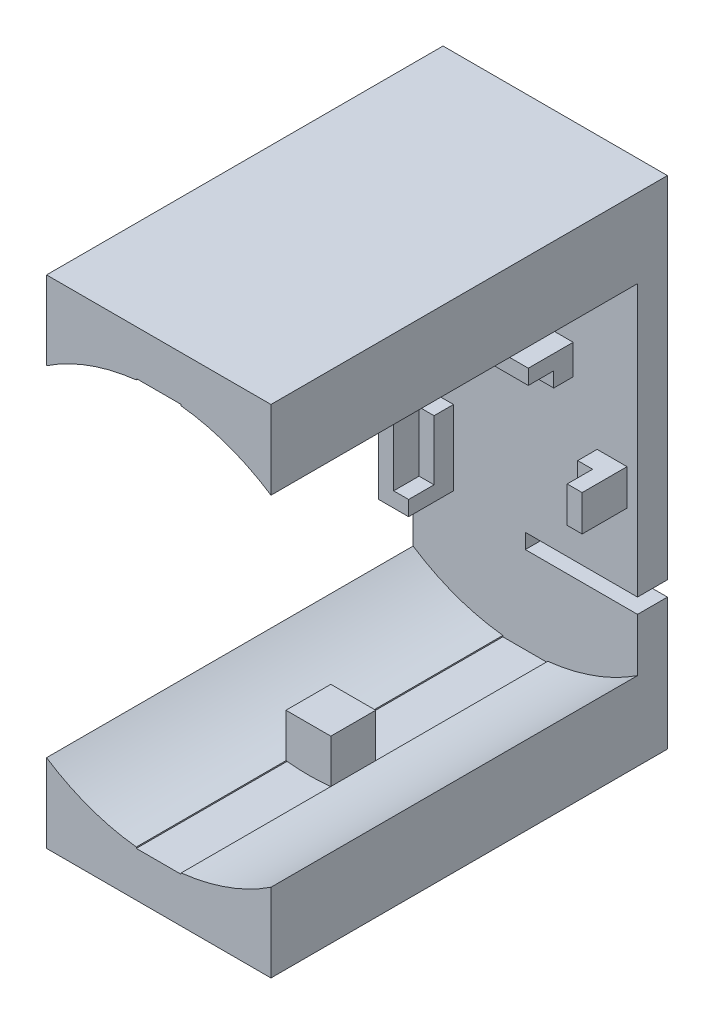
ISO-10303-21;
HEADER;
FILE_DESCRIPTION(('STEP AP214'),'2;1');
FILE_NAME('part.step','',(''),(''),'','','');
FILE_SCHEMA(('AUTOMOTIVE_DESIGN { 1 0 10303 214 1 1 1 1 }'));
ENDSEC;
DATA;
#1=APPLICATION_CONTEXT('core data for automotive mechanical design processes');
#2=APPLICATION_PROTOCOL_DEFINITION('international standard','automotive_design',2000,#1);
#3=PRODUCT_CONTEXT('',#1,'mechanical');
#4=PRODUCT('Part','Part','',(#3));
#5=PRODUCT_RELATED_PRODUCT_CATEGORY('part','',(#4));
#6=PRODUCT_DEFINITION_FORMATION('','',#4);
#7=PRODUCT_DEFINITION_CONTEXT('part definition',#1,'design');
#8=PRODUCT_DEFINITION('design','',#6,#7);
#9=PRODUCT_DEFINITION_SHAPE('','',#8);
#10=(LENGTH_UNIT() NAMED_UNIT(*) SI_UNIT(.MILLI.,.METRE.));
#11=(NAMED_UNIT(*) PLANE_ANGLE_UNIT() SI_UNIT($,.RADIAN.));
#12=(NAMED_UNIT(*) SI_UNIT($,.STERADIAN.) SOLID_ANGLE_UNIT());
#13=UNCERTAINTY_MEASURE_WITH_UNIT(LENGTH_MEASURE(1.E-05),#10,'distance_accuracy_value','');
#14=(GEOMETRIC_REPRESENTATION_CONTEXT(3) GLOBAL_UNCERTAINTY_ASSIGNED_CONTEXT((#13)) GLOBAL_UNIT_ASSIGNED_CONTEXT((#10,
#11,#12)) REPRESENTATION_CONTEXT('',''));
#15=CARTESIAN_POINT('',(0.,0.,0.));
#16=DIRECTION('',(0.,0.,1.));
#17=DIRECTION('',(1.,0.,0.));
#18=AXIS2_PLACEMENT_3D('',#15,#16,#17);
#19=CARTESIAN_POINT('',(-1.50000000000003,0.,14.5));
#20=DIRECTION('',(1.,0.,0.));
#21=DIRECTION('',(0.,1.,0.));
#22=AXIS2_PLACEMENT_3D('',#19,#20,#21);
#23=PLANE('',#22);
#24=DIRECTION('',(0.,0.,-1.));
#25=VECTOR('',#24,1.);
#26=CARTESIAN_POINT('',(-1.5,-10.6,14.5));
#27=LINE('',#26,#25);
#28=CARTESIAN_POINT('',(-1.5,-10.6,14.5));
#29=VERTEX_POINT('',#28);
#30=CARTESIAN_POINT('',(-1.5,-10.6,11.5));
#31=VERTEX_POINT('',#30);
#32=EDGE_CURVE('E195',#29,#31,#27,.T.);
#33=ORIENTED_EDGE('',*,*,#32,.T.);
#34=DIRECTION('',(0.,-1.,0.));
#35=VECTOR('',#34,1.);
#36=CARTESIAN_POINT('',(-1.50000000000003,0.,11.5));
#37=LINE('',#36,#35);
#38=CARTESIAN_POINT('',(-1.49999999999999,-13.517026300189,11.5));
#39=VERTEX_POINT('',#38);
#40=EDGE_CURVE('E188',#31,#39,#37,.T.);
#41=ORIENTED_EDGE('',*,*,#40,.T.);
#42=DIRECTION('',(0.,0.,-1.));
#43=VECTOR('',#42,1.);
#44=CARTESIAN_POINT('',(-1.49999999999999,-13.517026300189,14.5));
#45=LINE('',#44,#43);
#46=CARTESIAN_POINT('',(-1.49999999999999,-13.517026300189,14.5));
#47=VERTEX_POINT('',#46);
#48=EDGE_CURVE('E14',#47,#39,#45,.T.);
#49=ORIENTED_EDGE('',*,*,#48,.F.);
#50=DIRECTION('',(0.,-1.,0.));
#51=VECTOR('',#50,1.);
#52=CARTESIAN_POINT('',(-1.50000000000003,0.,14.5));
#53=LINE('',#52,#51);
#54=EDGE_CURVE('E227',#29,#47,#53,.T.);
#55=ORIENTED_EDGE('',*,*,#54,.F.);
#56=EDGE_LOOP('',(#33,#41,#49,#55));
#57=FACE_BOUND('',#56,.T.);
#58=ADVANCED_FACE('F174',(#57),#23,.F.);
#59=CARTESIAN_POINT('',(0.,0.,14.5));
#60=DIRECTION('',(0.,0.,-1.));
#61=DIRECTION('',(-1.,0.,0.));
#62=AXIS2_PLACEMENT_3D('',#59,#60,#61);
#63=CYLINDRICAL_SURFACE('',#62,13.6);
#64=ORIENTED_EDGE('',*,*,#48,.T.);
#65=CARTESIAN_POINT('',(0.,0.,11.5));
#66=DIRECTION('',(0.,0.,1.));
#67=DIRECTION('',(1.,0.,0.));
#68=AXIS2_PLACEMENT_3D('',#65,#66,#67);
#69=CIRCLE('',#68,13.6);
#70=CARTESIAN_POINT('',(1.5,-13.517026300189,11.5));
#71=VERTEX_POINT('',#70);
#72=EDGE_CURVE('E218',#39,#71,#69,.T.);
#73=ORIENTED_EDGE('',*,*,#72,.T.);
#74=DIRECTION('',(0.,0.,-1.));
#75=VECTOR('',#74,1.);
#76=CARTESIAN_POINT('',(1.5,-13.517026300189,14.5));
#77=LINE('',#76,#75);
#78=CARTESIAN_POINT('',(1.5,-13.517026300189,14.5));
#79=VERTEX_POINT('',#78);
#80=EDGE_CURVE('E181',#79,#71,#77,.T.);
#81=ORIENTED_EDGE('',*,*,#80,.F.);
#82=CARTESIAN_POINT('',(0.,0.,14.5));
#83=DIRECTION('',(0.,0.,1.));
#84=DIRECTION('',(1.,0.,0.));
#85=AXIS2_PLACEMENT_3D('',#82,#83,#84);
#86=CIRCLE('',#85,13.6);
#87=EDGE_CURVE('E238',#47,#79,#86,.T.);
#88=ORIENTED_EDGE('',*,*,#87,.F.);
#89=EDGE_LOOP('',(#64,#73,#81,#88));
#90=FACE_BOUND('',#89,.T.);
#91=ADVANCED_FACE('F246',(#90),#63,.T.);
#92=CARTESIAN_POINT('',(1.50000000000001,0.,14.5));
#93=DIRECTION('',(1.,0.,0.));
#94=DIRECTION('',(0.,1.,0.));
#95=AXIS2_PLACEMENT_3D('',#92,#93,#94);
#96=PLANE('',#95);
#97=DIRECTION('',(0.,-1.,0.));
#98=VECTOR('',#97,1.);
#99=CARTESIAN_POINT('',(1.50000000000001,0.,11.5));
#100=LINE('',#99,#98);
#101=CARTESIAN_POINT('',(1.5,-10.6,11.5));
#102=VERTEX_POINT('',#101);
#103=EDGE_CURVE('E215',#102,#71,#100,.T.);
#104=ORIENTED_EDGE('',*,*,#103,.F.);
#105=DIRECTION('',(0.,0.,-1.));
#106=VECTOR('',#105,1.);
#107=CARTESIAN_POINT('',(1.5,-10.6,14.5));
#108=LINE('',#107,#106);
#109=CARTESIAN_POINT('',(1.5,-10.6,14.5));
#110=VERTEX_POINT('',#109);
#111=EDGE_CURVE('E224',#110,#102,#108,.T.);
#112=ORIENTED_EDGE('',*,*,#111,.F.);
#113=DIRECTION('',(0.,-1.,0.));
#114=VECTOR('',#113,1.);
#115=CARTESIAN_POINT('',(1.50000000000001,0.,14.5));
#116=LINE('',#115,#114);
#117=EDGE_CURVE('E236',#110,#79,#116,.T.);
#118=ORIENTED_EDGE('',*,*,#117,.T.);
#119=ORIENTED_EDGE('',*,*,#80,.T.);
#120=EDGE_LOOP('',(#104,#112,#118,#119));
#121=FACE_BOUND('',#120,.T.);
#122=ADVANCED_FACE('F222',(#121),#96,.T.);
#123=CARTESIAN_POINT('',(0.,-10.6,14.5));
#124=DIRECTION('',(0.,1.,0.));
#125=DIRECTION('',(0.,0.,1.));
#126=AXIS2_PLACEMENT_3D('',#123,#124,#125);
#127=PLANE('',#126);
#128=DIRECTION('',(1.,0.,0.));
#129=VECTOR('',#128,1.);
#130=CARTESIAN_POINT('',(0.,-10.6,11.5));
#131=LINE('',#130,#129);
#132=EDGE_CURVE('E212',#31,#102,#131,.T.);
#133=ORIENTED_EDGE('',*,*,#132,.F.);
#134=ORIENTED_EDGE('',*,*,#32,.F.);
#135=DIRECTION('',(1.,0.,0.));
#136=VECTOR('',#135,1.);
#137=CARTESIAN_POINT('',(0.,-10.6,14.5));
#138=LINE('',#137,#136);
#139=EDGE_CURVE('E231',#29,#110,#138,.T.);
#140=ORIENTED_EDGE('',*,*,#139,.T.);
#141=ORIENTED_EDGE('',*,*,#111,.T.);
#142=EDGE_LOOP('',(#133,#134,#140,#141));
#143=FACE_BOUND('',#142,.T.);
#144=ADVANCED_FACE('F229',(#143),#127,.T.);
#145=CARTESIAN_POINT('',(0.,0.,14.5));
#146=DIRECTION('',(0.,0.,1.));
#147=DIRECTION('',(1.,0.,0.));
#148=AXIS2_PLACEMENT_3D('',#145,#146,#147);
#149=PLANE('',#148);
#150=ORIENTED_EDGE('',*,*,#54,.T.);
#151=ORIENTED_EDGE('',*,*,#87,.T.);
#152=ORIENTED_EDGE('',*,*,#117,.F.);
#153=ORIENTED_EDGE('',*,*,#139,.F.);
#154=EDGE_LOOP('',(#150,#151,#152,#153));
#155=FACE_BOUND('',#154,.T.);
#156=ADVANCED_FACE('F248',(#155),#149,.T.);
#157=CARTESIAN_POINT('',(0.,0.,11.5));
#158=DIRECTION('',(0.,0.,1.));
#159=DIRECTION('',(1.,0.,0.));
#160=AXIS2_PLACEMENT_3D('',#157,#158,#159);
#161=PLANE('',#160);
#162=ORIENTED_EDGE('',*,*,#132,.T.);
#163=ORIENTED_EDGE('',*,*,#103,.T.);
#164=ORIENTED_EDGE('',*,*,#72,.F.);
#165=ORIENTED_EDGE('',*,*,#40,.F.);
#166=EDGE_LOOP('',(#162,#163,#164,#165));
#167=FACE_BOUND('',#166,.T.);
#168=ADVANCED_FACE('F214',(#167),#161,.F.);
#169=CLOSED_SHELL('',(#58,#91,#122,#144,#156,#168));
#170=MANIFOLD_SOLID_BREP('B2',#169);
#171=CARTESIAN_POINT('',(1.5,0.,14.5));
#172=DIRECTION('',(1.,0.,0.));
#173=DIRECTION('',(0.,1.,0.));
#174=AXIS2_PLACEMENT_3D('',#171,#172,#173);
#175=PLANE('',#174);
#176=DIRECTION('',(0.,-1.,0.));
#177=VECTOR('',#176,1.);
#178=CARTESIAN_POINT('',(1.5,0.,11.5));
#179=LINE('',#178,#177);
#180=CARTESIAN_POINT('',(1.5,13.517026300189,11.5));
#181=VERTEX_POINT('',#180);
#182=CARTESIAN_POINT('',(1.5,10.6,11.5));
#183=VERTEX_POINT('',#182);
#184=EDGE_CURVE('E322',#181,#183,#179,.T.);
#185=ORIENTED_EDGE('',*,*,#184,.F.);
#186=DIRECTION('',(0.,0.,-1.));
#187=VECTOR('',#186,1.);
#188=CARTESIAN_POINT('',(1.5,13.517026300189,14.5));
#189=LINE('',#188,#187);
#190=CARTESIAN_POINT('',(1.5,13.517026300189,14.5));
#191=VERTEX_POINT('',#190);
#192=EDGE_CURVE('E172',#191,#181,#189,.T.);
#193=ORIENTED_EDGE('',*,*,#192,.F.);
#194=DIRECTION('',(0.,-1.,0.));
#195=VECTOR('',#194,1.);
#196=CARTESIAN_POINT('',(1.5,0.,14.5));
#197=LINE('',#196,#195);
#198=CARTESIAN_POINT('',(1.5,10.6,14.5));
#199=VERTEX_POINT('',#198);
#200=EDGE_CURVE('E354',#191,#199,#197,.T.);
#201=ORIENTED_EDGE('',*,*,#200,.T.);
#202=DIRECTION('',(0.,0.,-1.));
#203=VECTOR('',#202,1.);
#204=CARTESIAN_POINT('',(1.5,10.6,14.5));
#205=LINE('',#204,#203);
#206=EDGE_CURVE('E366',#199,#183,#205,.T.);
#207=ORIENTED_EDGE('',*,*,#206,.T.);
#208=EDGE_LOOP('',(#185,#193,#201,#207));
#209=FACE_BOUND('',#208,.T.);
#210=ADVANCED_FACE('F308',(#209),#175,.T.);
#211=CARTESIAN_POINT('',(0.,0.,14.5));
#212=DIRECTION('',(0.,0.,-1.));
#213=DIRECTION('',(-1.,0.,0.));
#214=AXIS2_PLACEMENT_3D('',#211,#212,#213);
#215=CYLINDRICAL_SURFACE('',#214,13.6);
#216=ORIENTED_EDGE('',*,*,#192,.T.);
#217=CARTESIAN_POINT('',(0.,0.,11.5));
#218=DIRECTION('',(0.,0.,1.));
#219=DIRECTION('',(1.,0.,0.));
#220=AXIS2_PLACEMENT_3D('',#217,#218,#219);
#221=CIRCLE('',#220,13.6);
#222=CARTESIAN_POINT('',(-1.5,13.517026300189,11.5));
#223=VERTEX_POINT('',#222);
#224=EDGE_CURVE('E363',#181,#223,#221,.T.);
#225=ORIENTED_EDGE('',*,*,#224,.T.);
#226=DIRECTION('',(0.,0.,-1.));
#227=VECTOR('',#226,1.);
#228=CARTESIAN_POINT('',(-1.5,13.517026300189,14.5));
#229=LINE('',#228,#227);
#230=CARTESIAN_POINT('',(-1.5,13.517026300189,14.5));
#231=VERTEX_POINT('',#230);
#232=EDGE_CURVE('E315',#231,#223,#229,.T.);
#233=ORIENTED_EDGE('',*,*,#232,.F.);
#234=CARTESIAN_POINT('',(0.,0.,14.5));
#235=DIRECTION('',(0.,0.,1.));
#236=DIRECTION('',(1.,0.,0.));
#237=AXIS2_PLACEMENT_3D('',#234,#235,#236);
#238=CIRCLE('',#237,13.6);
#239=EDGE_CURVE('E373',#191,#231,#238,.T.);
#240=ORIENTED_EDGE('',*,*,#239,.F.);
#241=EDGE_LOOP('',(#216,#225,#233,#240));
#242=FACE_BOUND('',#241,.T.);
#243=ADVANCED_FACE('F379',(#242),#215,.T.);
#244=CARTESIAN_POINT('',(-1.5,0.,14.5));
#245=DIRECTION('',(1.,0.,0.));
#246=DIRECTION('',(0.,0.,-1.));
#247=AXIS2_PLACEMENT_3D('',#244,#245,#246);
#248=PLANE('',#247);
#249=ORIENTED_EDGE('',*,*,#232,.T.);
#250=DIRECTION('',(0.,-1.,0.));
#251=VECTOR('',#250,1.);
#252=CARTESIAN_POINT('',(-1.5,0.,11.5));
#253=LINE('',#252,#251);
#254=CARTESIAN_POINT('',(-1.5,10.6,11.5));
#255=VERTEX_POINT('',#254);
#256=EDGE_CURVE('E349',#223,#255,#253,.T.);
#257=ORIENTED_EDGE('',*,*,#256,.T.);
#258=DIRECTION('',(0.,0.,-1.));
#259=VECTOR('',#258,1.);
#260=CARTESIAN_POINT('',(-1.5,10.6,14.5));
#261=LINE('',#260,#259);
#262=CARTESIAN_POINT('',(-1.5,10.6,14.5));
#263=VERTEX_POINT('',#262);
#264=EDGE_CURVE('E361',#263,#255,#261,.T.);
#265=ORIENTED_EDGE('',*,*,#264,.F.);
#266=DIRECTION('',(0.,-1.,0.));
#267=VECTOR('',#266,1.);
#268=CARTESIAN_POINT('',(-1.5,0.,14.5));
#269=LINE('',#268,#267);
#270=EDGE_CURVE('E371',#231,#263,#269,.T.);
#271=ORIENTED_EDGE('',*,*,#270,.F.);
#272=EDGE_LOOP('',(#249,#257,#265,#271));
#273=FACE_BOUND('',#272,.T.);
#274=ADVANCED_FACE('F359',(#273),#248,.F.);
#275=CARTESIAN_POINT('',(0.,10.6,14.5));
#276=DIRECTION('',(0.,1.,0.));
#277=DIRECTION('',(0.,0.,1.));
#278=AXIS2_PLACEMENT_3D('',#275,#276,#277);
#279=PLANE('',#278);
#280=ORIENTED_EDGE('',*,*,#264,.T.);
#281=DIRECTION('',(1.,0.,0.));
#282=VECTOR('',#281,1.);
#283=CARTESIAN_POINT('',(0.,10.6,11.5));
#284=LINE('',#283,#282);
#285=EDGE_CURVE('E346',#255,#183,#284,.T.);
#286=ORIENTED_EDGE('',*,*,#285,.T.);
#287=ORIENTED_EDGE('',*,*,#206,.F.);
#288=DIRECTION('',(1.,0.,0.));
#289=VECTOR('',#288,1.);
#290=CARTESIAN_POINT('',(0.,10.6,14.5));
#291=LINE('',#290,#289);
#292=EDGE_CURVE('E330',#263,#199,#291,.T.);
#293=ORIENTED_EDGE('',*,*,#292,.F.);
#294=EDGE_LOOP('',(#280,#286,#287,#293));
#295=FACE_BOUND('',#294,.T.);
#296=ADVANCED_FACE('F365',(#295),#279,.F.);
#297=CARTESIAN_POINT('',(0.,0.,14.5));
#298=DIRECTION('',(0.,0.,1.));
#299=DIRECTION('',(1.,0.,0.));
#300=AXIS2_PLACEMENT_3D('',#297,#298,#299);
#301=PLANE('',#300);
#302=ORIENTED_EDGE('',*,*,#200,.F.);
#303=ORIENTED_EDGE('',*,*,#239,.T.);
#304=ORIENTED_EDGE('',*,*,#270,.T.);
#305=ORIENTED_EDGE('',*,*,#292,.T.);
#306=EDGE_LOOP('',(#302,#303,#304,#305));
#307=FACE_BOUND('',#306,.T.);
#308=ADVANCED_FACE('F382',(#307),#301,.T.);
#309=CARTESIAN_POINT('',(0.,0.,11.5));
#310=DIRECTION('',(0.,0.,1.));
#311=DIRECTION('',(1.,0.,0.));
#312=AXIS2_PLACEMENT_3D('',#309,#310,#311);
#313=PLANE('',#312);
#314=ORIENTED_EDGE('',*,*,#184,.T.);
#315=ORIENTED_EDGE('',*,*,#285,.F.);
#316=ORIENTED_EDGE('',*,*,#256,.F.);
#317=ORIENTED_EDGE('',*,*,#224,.F.);
#318=EDGE_LOOP('',(#314,#315,#316,#317));
#319=FACE_BOUND('',#318,.T.);
#320=ADVANCED_FACE('F348',(#319),#313,.F.);
#321=CLOSED_SHELL('',(#210,#243,#274,#296,#308,#320));
#322=MANIFOLD_SOLID_BREP('B8',#321);
#323=CARTESIAN_POINT('',(7.5,0.,14.5));
#324=DIRECTION('',(1.,0.,0.));
#325=DIRECTION('',(0.,0.,-1.));
#326=AXIS2_PLACEMENT_3D('',#323,#324,#325);
#327=PLANE('',#326);
#328=DIRECTION('',(0.,-1.,0.));
#329=VECTOR('',#328,1.);
#330=CARTESIAN_POINT('',(7.5,0.,-2.));
#331=LINE('',#330,#329);
#332=CARTESIAN_POINT('',(7.5,-7.8,-2.));
#333=VERTEX_POINT('',#332);
#334=CARTESIAN_POINT('',(7.5,-16.6,-2.));
#335=VERTEX_POINT('',#334);
#336=EDGE_CURVE('E1046',#333,#335,#331,.T.);
#337=ORIENTED_EDGE('',*,*,#336,.F.);
#338=DIRECTION('',(0.,0.,1.));
#339=VECTOR('',#338,1.);
#340=CARTESIAN_POINT('',(7.5,-7.8,-2.));
#341=LINE('',#340,#339);
#342=CARTESIAN_POINT('',(7.5,-7.8,0.));
#343=VERTEX_POINT('',#342);
#344=EDGE_CURVE('E727',#333,#343,#341,.T.);
#345=ORIENTED_EDGE('',*,*,#344,.T.);
#346=DIRECTION('',(0.,-1.,0.));
#347=VECTOR('',#346,1.);
#348=CARTESIAN_POINT('',(7.5,0.,0.));
#349=LINE('',#348,#347);
#350=CARTESIAN_POINT('',(7.5,-11.3450429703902,0.));
#351=VERTEX_POINT('',#350);
#352=EDGE_CURVE('E1042',#343,#351,#349,.T.);
#353=ORIENTED_EDGE('',*,*,#352,.T.);
#354=DIRECTION('',(0.,0.,-1.));
#355=VECTOR('',#354,1.);
#356=CARTESIAN_POINT('',(7.5,-11.3450429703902,14.5));
#357=LINE('',#356,#355);
#358=CARTESIAN_POINT('',(7.5,-11.3450429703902,24.5));
#359=VERTEX_POINT('',#358);
#360=EDGE_CURVE('E1034',#359,#351,#357,.T.);
#361=ORIENTED_EDGE('',*,*,#360,.F.);
#362=DIRECTION('',(0.,-1.,0.));
#363=VECTOR('',#362,1.);
#364=CARTESIAN_POINT('',(7.5,0.,24.5));
#365=LINE('',#364,#363);
#366=CARTESIAN_POINT('',(7.5,-16.6,24.5));
#367=VERTEX_POINT('',#366);
#368=EDGE_CURVE('E952',#359,#367,#365,.T.);
#369=ORIENTED_EDGE('',*,*,#368,.T.);
#370=DIRECTION('',(0.,0.,1.));
#371=VECTOR('',#370,1.);
#372=CARTESIAN_POINT('',(7.5,-16.6,-2.));
#373=LINE('',#372,#371);
#374=EDGE_CURVE('E1065',#335,#367,#373,.T.);
#375=ORIENTED_EDGE('',*,*,#374,.F.);
#376=EDGE_LOOP('',(#337,#345,#353,#361,#369,#375));
#377=FACE_BOUND('',#376,.T.);
#378=ADVANCED_FACE('F433',(#377),#327,.T.);
#379=CARTESIAN_POINT('',(0.,0.,0.));
#380=DIRECTION('',(0.,0.,1.));
#381=DIRECTION('',(1.,0.,0.));
#382=AXIS2_PLACEMENT_3D('',#379,#380,#381);
#383=PLANE('',#382);
#384=DIRECTION('',(-1.,0.,0.));
#385=VECTOR('',#384,1.);
#386=CARTESIAN_POINT('',(0.,-6.8,0.));
#387=LINE('',#386,#385);
#388=CARTESIAN_POINT('',(7.5,-6.8,0.));
#389=VERTEX_POINT('',#388);
#390=CARTESIAN_POINT('',(0.,-6.8,0.));
#391=VERTEX_POINT('',#390);
#392=EDGE_CURVE('E692',#389,#391,#387,.T.);
#393=ORIENTED_EDGE('',*,*,#392,.F.);
#394=CARTESIAN_POINT('',(7.5,11.3450429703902,0.));
#395=VERTEX_POINT('',#394);
#396=EDGE_CURVE('E1058',#395,#389,#349,.T.);
#397=ORIENTED_EDGE('',*,*,#396,.F.);
#398=CARTESIAN_POINT('',(0.,0.,0.));
#399=DIRECTION('',(0.,0.,1.));
#400=DIRECTION('',(1.,0.,0.));
#401=AXIS2_PLACEMENT_3D('',#398,#399,#400);
#402=CIRCLE('',#401,13.6);
#403=CARTESIAN_POINT('',(1.5,13.517026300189,0.));
#404=VERTEX_POINT('',#403);
#405=EDGE_CURVE('E1068',#395,#404,#402,.T.);
#406=ORIENTED_EDGE('',*,*,#405,.T.);
#407=DIRECTION('',(0.,-1.,0.));
#408=VECTOR('',#407,1.);
#409=CARTESIAN_POINT('',(1.5,0.,0.));
#410=LINE('',#409,#408);
#411=CARTESIAN_POINT('',(1.5,13.6,0.));
#412=VERTEX_POINT('',#411);
#413=EDGE_CURVE('E1082',#412,#404,#410,.T.);
#414=ORIENTED_EDGE('',*,*,#413,.F.);
#415=DIRECTION('',(1.,0.,0.));
#416=VECTOR('',#415,1.);
#417=CARTESIAN_POINT('',(0.,13.6,0.));
#418=LINE('',#417,#416);
#419=CARTESIAN_POINT('',(-1.5,13.6,0.));
#420=VERTEX_POINT('',#419);
#421=EDGE_CURVE('E1079',#420,#412,#418,.T.);
#422=ORIENTED_EDGE('',*,*,#421,.F.);
#423=DIRECTION('',(0.,-1.,0.));
#424=VECTOR('',#423,1.);
#425=CARTESIAN_POINT('',(-1.5,0.,0.));
#426=LINE('',#425,#424);
#427=CARTESIAN_POINT('',(-1.5,13.517026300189,0.));
#428=VERTEX_POINT('',#427);
#429=EDGE_CURVE('E1075',#420,#428,#426,.T.);
#430=ORIENTED_EDGE('',*,*,#429,.T.);
#431=CARTESIAN_POINT('',(-7.5,11.3450429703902,0.));
#432=VERTEX_POINT('',#431);
#433=EDGE_CURVE('E1074',#428,#432,#402,.T.);
#434=ORIENTED_EDGE('',*,*,#433,.T.);
#435=DIRECTION('',(0.,-1.,0.));
#436=VECTOR('',#435,1.);
#437=CARTESIAN_POINT('',(-7.5,0.,0.));
#438=LINE('',#437,#436);
#439=CARTESIAN_POINT('',(-7.5,-11.3450429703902,0.));
#440=VERTEX_POINT('',#439);
#441=EDGE_CURVE('E1062',#432,#440,#438,.T.);
#442=ORIENTED_EDGE('',*,*,#441,.T.);
#443=CARTESIAN_POINT('',(0.,0.,0.));
#444=DIRECTION('',(0.,0.,1.));
#445=DIRECTION('',(1.,0.,0.));
#446=AXIS2_PLACEMENT_3D('',#443,#444,#445);
#447=CIRCLE('',#446,13.6);
#448=CARTESIAN_POINT('',(-1.49999999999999,-13.517026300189,0.));
#449=VERTEX_POINT('',#448);
#450=EDGE_CURVE('E1004',#440,#449,#447,.T.);
#451=ORIENTED_EDGE('',*,*,#450,.T.);
#452=DIRECTION('',(0.,-1.,0.));
#453=VECTOR('',#452,1.);
#454=CARTESIAN_POINT('',(-1.50000000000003,0.,0.));
#455=LINE('',#454,#453);
#456=CARTESIAN_POINT('',(-1.49999999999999,-13.6,0.));
#457=VERTEX_POINT('',#456);
#458=EDGE_CURVE('E1015',#449,#457,#455,.T.);
#459=ORIENTED_EDGE('',*,*,#458,.T.);
#460=DIRECTION('',(1.,0.,0.));
#461=VECTOR('',#460,1.);
#462=CARTESIAN_POINT('',(0.,-13.6,0.));
#463=LINE('',#462,#461);
#464=CARTESIAN_POINT('',(1.5,-13.6,0.));
#465=VERTEX_POINT('',#464);
#466=EDGE_CURVE('E1012',#457,#465,#463,.T.);
#467=ORIENTED_EDGE('',*,*,#466,.T.);
#468=DIRECTION('',(0.,-1.,0.));
#469=VECTOR('',#468,1.);
#470=CARTESIAN_POINT('',(1.50000000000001,0.,0.));
#471=LINE('',#470,#469);
#472=CARTESIAN_POINT('',(1.5,-13.517026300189,0.));
#473=VERTEX_POINT('',#472);
#474=EDGE_CURVE('E1008',#473,#465,#471,.T.);
#475=ORIENTED_EDGE('',*,*,#474,.F.);
#476=EDGE_CURVE('E1007',#473,#351,#447,.T.);
#477=ORIENTED_EDGE('',*,*,#476,.T.);
#478=ORIENTED_EDGE('',*,*,#352,.F.);
#479=DIRECTION('',(-1.,0.,0.));
#480=VECTOR('',#479,1.);
#481=CARTESIAN_POINT('',(0.,-7.8,0.));
#482=LINE('',#481,#480);
#483=CARTESIAN_POINT('',(0.,-7.8,0.));
#484=VERTEX_POINT('',#483);
#485=EDGE_CURVE('E710',#343,#484,#482,.T.);
#486=ORIENTED_EDGE('',*,*,#485,.T.);
#487=DIRECTION('',(0.,-1.,0.));
#488=VECTOR('',#487,1.);
#489=CARTESIAN_POINT('',(0.,0.,0.));
#490=LINE('',#489,#488);
#491=EDGE_CURVE('E714',#391,#484,#490,.T.);
#492=ORIENTED_EDGE('',*,*,#491,.F.);
#493=EDGE_LOOP('',(#393,#397,#406,#414,#422,#430,#434,#442,#451,#459,#467,#475,#477,#478,#486,#492));
#494=FACE_BOUND('',#493,.T.);
#495=DIRECTION('',(0.,-1.,0.));
#496=VECTOR('',#495,1.);
#497=CARTESIAN_POINT('',(-6.8,0.,0.));
#498=LINE('',#497,#496);
#499=CARTESIAN_POINT('',(-6.8,-1.8,0.));
#500=VERTEX_POINT('',#499);
#501=CARTESIAN_POINT('',(-6.8,-6.8,0.));
#502=VERTEX_POINT('',#501);
#503=EDGE_CURVE('E765',#500,#502,#498,.T.);
#504=ORIENTED_EDGE('',*,*,#503,.F.);
#505=DIRECTION('',(1.,0.,0.));
#506=VECTOR('',#505,1.);
#507=CARTESIAN_POINT('',(0.,-1.8,0.));
#508=LINE('',#507,#506);
#509=CARTESIAN_POINT('',(-4.8,-1.8,0.));
#510=VERTEX_POINT('',#509);
#511=EDGE_CURVE('E915',#500,#510,#508,.T.);
#512=ORIENTED_EDGE('',*,*,#511,.T.);
#513=DIRECTION('',(0.,-1.,0.));
#514=VECTOR('',#513,1.);
#515=CARTESIAN_POINT('',(-4.8,0.,0.));
#516=LINE('',#515,#514);
#517=CARTESIAN_POINT('',(-4.8,-6.8,0.));
#518=VERTEX_POINT('',#517);
#519=EDGE_CURVE('E921',#510,#518,#516,.T.);
#520=ORIENTED_EDGE('',*,*,#519,.T.);
#521=DIRECTION('',(1.,0.,0.));
#522=VECTOR('',#521,1.);
#523=CARTESIAN_POINT('',(0.,-6.8,0.));
#524=LINE('',#523,#522);
#525=EDGE_CURVE('E771',#502,#518,#524,.T.);
#526=ORIENTED_EDGE('',*,*,#525,.F.);
#527=EDGE_LOOP('',(#504,#512,#520,#526));
#528=FACE_BOUND('',#527,.T.);
#529=DIRECTION('',(1.,0.,0.));
#530=VECTOR('',#529,1.);
#531=CARTESIAN_POINT('',(0.,5.8,0.));
#532=LINE('',#531,#530);
#533=CARTESIAN_POINT('',(-3.2,5.8,0.));
#534=VERTEX_POINT('',#533);
#535=CARTESIAN_POINT('',(3.2,5.8,0.));
#536=VERTEX_POINT('',#535);
#537=EDGE_CURVE('E818',#534,#536,#532,.T.);
#538=ORIENTED_EDGE('',*,*,#537,.T.);
#539=DIRECTION('',(0.,-1.,0.));
#540=VECTOR('',#539,1.);
#541=CARTESIAN_POINT('',(3.2,0.,0.));
#542=LINE('',#541,#540);
#543=CARTESIAN_POINT('',(3.2,3.8,0.));
#544=VERTEX_POINT('',#543);
#545=EDGE_CURVE('E883',#536,#544,#542,.T.);
#546=ORIENTED_EDGE('',*,*,#545,.T.);
#547=DIRECTION('',(1.,0.,0.));
#548=VECTOR('',#547,1.);
#549=CARTESIAN_POINT('',(0.,3.8,0.));
#550=LINE('',#549,#548);
#551=CARTESIAN_POINT('',(-3.2,3.8,0.));
#552=VERTEX_POINT('',#551);
#553=EDGE_CURVE('E889',#552,#544,#550,.T.);
#554=ORIENTED_EDGE('',*,*,#553,.F.);
#555=DIRECTION('',(0.,-1.,0.));
#556=VECTOR('',#555,1.);
#557=CARTESIAN_POINT('',(-3.2,0.,0.));
#558=LINE('',#557,#556);
#559=EDGE_CURVE('E903',#534,#552,#558,.T.);
#560=ORIENTED_EDGE('',*,*,#559,.F.);
#561=EDGE_LOOP('',(#538,#546,#554,#560));
#562=FACE_BOUND('',#561,.T.);
#563=DIRECTION('',(-1.,0.,0.));
#564=VECTOR('',#563,1.);
#565=CARTESIAN_POINT('',(0.,0.4,0.));
#566=LINE('',#565,#564);
#567=CARTESIAN_POINT('',(6.8,0.400000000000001,0.));
#568=VERTEX_POINT('',#567);
#569=CARTESIAN_POINT('',(4.8,0.400000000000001,0.));
#570=VERTEX_POINT('',#569);
#571=EDGE_CURVE('E457',#568,#570,#566,.T.);
#572=ORIENTED_EDGE('',*,*,#571,.F.);
#573=DIRECTION('',(0.,-1.,0.));
#574=VECTOR('',#573,1.);
#575=CARTESIAN_POINT('',(6.8,0.,0.));
#576=LINE('',#575,#574);
#577=CARTESIAN_POINT('',(6.8,-2.,0.));
#578=VERTEX_POINT('',#577);
#579=EDGE_CURVE('E726',#568,#578,#576,.T.);
#580=ORIENTED_EDGE('',*,*,#579,.T.);
#581=DIRECTION('',(-1.,0.,0.));
#582=VECTOR('',#581,1.);
#583=CARTESIAN_POINT('',(0.,-2.,0.));
#584=LINE('',#583,#582);
#585=CARTESIAN_POINT('',(4.8,-2.,0.));
#586=VERTEX_POINT('',#585);
#587=EDGE_CURVE('E857',#578,#586,#584,.T.);
#588=ORIENTED_EDGE('',*,*,#587,.T.);
#589=DIRECTION('',(0.,-1.,0.));
#590=VECTOR('',#589,1.);
#591=CARTESIAN_POINT('',(4.8,0.,0.));
#592=LINE('',#591,#590);
#593=EDGE_CURVE('E870',#570,#586,#592,.T.);
#594=ORIENTED_EDGE('',*,*,#593,.F.);
#595=EDGE_LOOP('',(#572,#580,#588,#594));
#596=FACE_BOUND('',#595,.T.);
#597=ADVANCED_FACE('F1115',(#494,#528,#562,#596),#383,.T.);
#598=CARTESIAN_POINT('',(0.,0.,14.5));
#599=DIRECTION('',(0.,0.,-1.));
#600=DIRECTION('',(-1.,0.,0.));
#601=AXIS2_PLACEMENT_3D('',#598,#599,#600);
#602=CYLINDRICAL_SURFACE('',#601,13.6);
#603=ORIENTED_EDGE('',*,*,#405,.F.);
#604=DIRECTION('',(0.,0.,-1.));
#605=VECTOR('',#604,1.);
#606=CARTESIAN_POINT('',(7.5,11.3450429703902,14.5));
#607=LINE('',#606,#605);
#608=CARTESIAN_POINT('',(7.5,11.3450429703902,24.5));
#609=VERTEX_POINT('',#608);
#610=EDGE_CURVE('E306',#609,#395,#607,.T.);
#611=ORIENTED_EDGE('',*,*,#610,.F.);
#612=CARTESIAN_POINT('',(0.,0.,24.5));
#613=DIRECTION('',(0.,0.,1.));
#614=DIRECTION('',(1.,0.,0.));
#615=AXIS2_PLACEMENT_3D('',#612,#613,#614);
#616=CIRCLE('',#615,13.6);
#617=CARTESIAN_POINT('',(1.5,13.517026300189,24.5));
#618=VERTEX_POINT('',#617);
#619=EDGE_CURVE('E951',#609,#618,#616,.T.);
#620=ORIENTED_EDGE('',*,*,#619,.T.);
#621=DIRECTION('',(0.,0.,-1.));
#622=VECTOR('',#621,1.);
#623=CARTESIAN_POINT('',(1.5,13.517026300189,14.5));
#624=LINE('',#623,#622);
#625=EDGE_CURVE('E1086',#618,#404,#624,.T.);
#626=ORIENTED_EDGE('',*,*,#625,.T.);
#627=EDGE_LOOP('',(#603,#611,#620,#626));
#628=FACE_BOUND('',#627,.T.);
#629=ADVANCED_FACE('F1149',(#628),#602,.F.);
#630=DIRECTION('',(0.,0.,1.));
#631=VECTOR('',#630,1.);
#632=CARTESIAN_POINT('',(7.5,-6.8,-2.));
#633=LINE('',#632,#631);
#634=CARTESIAN_POINT('',(7.5,-6.8,-2.));
#635=VERTEX_POINT('',#634);
#636=EDGE_CURVE('E723',#635,#389,#633,.T.);
#637=ORIENTED_EDGE('',*,*,#636,.F.);
#638=CARTESIAN_POINT('',(7.5,16.6,-2.));
#639=VERTEX_POINT('',#638);
#640=EDGE_CURVE('E708',#639,#635,#331,.T.);
#641=ORIENTED_EDGE('',*,*,#640,.F.);
#642=DIRECTION('',(0.,0.,-1.));
#643=VECTOR('',#642,1.);
#644=CARTESIAN_POINT('',(7.5,16.6,14.5));
#645=LINE('',#644,#643);
#646=CARTESIAN_POINT('',(7.5,16.6,24.5));
#647=VERTEX_POINT('',#646);
#648=EDGE_CURVE('E442',#647,#639,#645,.T.);
#649=ORIENTED_EDGE('',*,*,#648,.F.);
#650=DIRECTION('',(0.,-1.,0.));
#651=VECTOR('',#650,1.);
#652=CARTESIAN_POINT('',(7.5,0.,24.5));
#653=LINE('',#652,#651);
#654=EDGE_CURVE('E994',#647,#609,#653,.T.);
#655=ORIENTED_EDGE('',*,*,#654,.T.);
#656=ORIENTED_EDGE('',*,*,#610,.T.);
#657=ORIENTED_EDGE('',*,*,#396,.T.);
#658=EDGE_LOOP('',(#637,#641,#649,#655,#656,#657));
#659=FACE_BOUND('',#658,.T.);
#660=ADVANCED_FACE('F435',(#659),#327,.T.);
#661=CARTESIAN_POINT('',(0.,16.6,14.5));
#662=DIRECTION('',(0.,1.,0.));
#663=DIRECTION('',(0.,0.,1.));
#664=AXIS2_PLACEMENT_3D('',#661,#662,#663);
#665=PLANE('',#664);
#666=ORIENTED_EDGE('',*,*,#648,.T.);
#667=DIRECTION('',(1.,0.,0.));
#668=VECTOR('',#667,1.);
#669=CARTESIAN_POINT('',(0.,16.6,-2.));
#670=LINE('',#669,#668);
#671=CARTESIAN_POINT('',(-7.5,16.6,-2.));
#672=VERTEX_POINT('',#671);
#673=EDGE_CURVE('E1045',#672,#639,#670,.T.);
#674=ORIENTED_EDGE('',*,*,#673,.F.);
#675=DIRECTION('',(0.,0.,-1.));
#676=VECTOR('',#675,1.);
#677=CARTESIAN_POINT('',(-7.5,16.6,14.5));
#678=LINE('',#677,#676);
#679=CARTESIAN_POINT('',(-7.5,16.6,24.5));
#680=VERTEX_POINT('',#679);
#681=EDGE_CURVE('E1102',#680,#672,#678,.T.);
#682=ORIENTED_EDGE('',*,*,#681,.F.);
#683=DIRECTION('',(1.,0.,0.));
#684=VECTOR('',#683,1.);
#685=CARTESIAN_POINT('',(0.,16.6,24.5));
#686=LINE('',#685,#684);
#687=EDGE_CURVE('E987',#680,#647,#686,.T.);
#688=ORIENTED_EDGE('',*,*,#687,.T.);
#689=EDGE_LOOP('',(#666,#674,#682,#688));
#690=FACE_BOUND('',#689,.T.);
#691=ADVANCED_FACE('F1107',(#690),#665,.T.);
#692=CARTESIAN_POINT('',(-7.5,0.,14.5));
#693=DIRECTION('',(1.,0.,0.));
#694=DIRECTION('',(0.,0.,-1.));
#695=AXIS2_PLACEMENT_3D('',#692,#693,#694);
#696=PLANE('',#695);
#697=DIRECTION('',(0.,0.,-1.));
#698=VECTOR('',#697,1.);
#699=CARTESIAN_POINT('',(-7.5,-11.3450429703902,14.5));
#700=LINE('',#699,#698);
#701=CARTESIAN_POINT('',(-7.5,-11.3450429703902,24.5));
#702=VERTEX_POINT('',#701);
#703=EDGE_CURVE('E1038',#702,#440,#700,.T.);
#704=ORIENTED_EDGE('',*,*,#703,.T.);
#705=ORIENTED_EDGE('',*,*,#441,.F.);
#706=DIRECTION('',(0.,0.,-1.));
#707=VECTOR('',#706,1.);
#708=CARTESIAN_POINT('',(-7.5,11.3450429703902,14.5));
#709=LINE('',#708,#707);
#710=CARTESIAN_POINT('',(-7.5,11.3450429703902,24.5));
#711=VERTEX_POINT('',#710);
#712=EDGE_CURVE('E1099',#711,#432,#709,.T.);
#713=ORIENTED_EDGE('',*,*,#712,.F.);
#714=DIRECTION('',(0.,-1.,0.));
#715=VECTOR('',#714,1.);
#716=CARTESIAN_POINT('',(-7.5,0.,24.5));
#717=LINE('',#716,#715);
#718=EDGE_CURVE('E978',#680,#711,#717,.T.);
#719=ORIENTED_EDGE('',*,*,#718,.F.);
#720=ORIENTED_EDGE('',*,*,#681,.T.);
#721=DIRECTION('',(0.,-1.,0.));
#722=VECTOR('',#721,1.);
#723=CARTESIAN_POINT('',(-7.5,0.,-2.));
#724=LINE('',#723,#722);
#725=CARTESIAN_POINT('',(-7.5,-16.6,-2.));
#726=VERTEX_POINT('',#725);
#727=EDGE_CURVE('E1049',#672,#726,#724,.T.);
#728=ORIENTED_EDGE('',*,*,#727,.T.);
#729=DIRECTION('',(0.,0.,1.));
#730=VECTOR('',#729,1.);
#731=CARTESIAN_POINT('',(-7.5,-16.6,-2.));
#732=LINE('',#731,#730);
#733=CARTESIAN_POINT('',(-7.5,-16.6,24.5));
#734=VERTEX_POINT('',#733);
#735=EDGE_CURVE('E1057',#726,#734,#732,.T.);
#736=ORIENTED_EDGE('',*,*,#735,.T.);
#737=DIRECTION('',(0.,-1.,0.));
#738=VECTOR('',#737,1.);
#739=CARTESIAN_POINT('',(-7.5,0.,24.5));
#740=LINE('',#739,#738);
#741=EDGE_CURVE('E940',#702,#734,#740,.T.);
#742=ORIENTED_EDGE('',*,*,#741,.F.);
#743=EDGE_LOOP('',(#704,#705,#713,#719,#720,#728,#736,#742));
#744=FACE_BOUND('',#743,.T.);
#745=ADVANCED_FACE('F1141',(#744),#696,.F.);
#746=ORIENTED_EDGE('',*,*,#433,.F.);
#747=DIRECTION('',(0.,0.,-1.));
#748=VECTOR('',#747,1.);
#749=CARTESIAN_POINT('',(-1.5,13.517026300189,14.5));
#750=LINE('',#749,#748);
#751=CARTESIAN_POINT('',(-1.5,13.517026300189,24.5));
#752=VERTEX_POINT('',#751);
#753=EDGE_CURVE('E1096',#752,#428,#750,.T.);
#754=ORIENTED_EDGE('',*,*,#753,.F.);
#755=CARTESIAN_POINT('',(0.,0.,24.5));
#756=DIRECTION('',(0.,0.,1.));
#757=DIRECTION('',(1.,0.,0.));
#758=AXIS2_PLACEMENT_3D('',#755,#756,#757);
#759=CIRCLE('',#758,13.6);
#760=EDGE_CURVE('E983',#752,#711,#759,.T.);
#761=ORIENTED_EDGE('',*,*,#760,.T.);
#762=ORIENTED_EDGE('',*,*,#712,.T.);
#763=EDGE_LOOP('',(#746,#754,#761,#762));
#764=FACE_BOUND('',#763,.T.);
#765=ADVANCED_FACE('F1198',(#764),#602,.F.);
#766=CARTESIAN_POINT('',(-1.5,0.,14.5));
#767=DIRECTION('',(1.,0.,0.));
#768=DIRECTION('',(0.,0.,-1.));
#769=AXIS2_PLACEMENT_3D('',#766,#767,#768);
#770=PLANE('',#769);
#771=ORIENTED_EDGE('',*,*,#429,.F.);
#772=DIRECTION('',(0.,0.,-1.));
#773=VECTOR('',#772,1.);
#774=CARTESIAN_POINT('',(-1.5,13.6,14.5));
#775=LINE('',#774,#773);
#776=CARTESIAN_POINT('',(-1.5,13.6,24.5));
#777=VERTEX_POINT('',#776);
#778=EDGE_CURVE('E1093',#777,#420,#775,.T.);
#779=ORIENTED_EDGE('',*,*,#778,.F.);
#780=DIRECTION('',(0.,-1.,0.));
#781=VECTOR('',#780,1.);
#782=CARTESIAN_POINT('',(-1.5,0.,24.5));
#783=LINE('',#782,#781);
#784=EDGE_CURVE('E979',#777,#752,#783,.T.);
#785=ORIENTED_EDGE('',*,*,#784,.T.);
#786=ORIENTED_EDGE('',*,*,#753,.T.);
#787=EDGE_LOOP('',(#771,#779,#785,#786));
#788=FACE_BOUND('',#787,.T.);
#789=ADVANCED_FACE('F1161',(#788),#770,.T.);
#790=CARTESIAN_POINT('',(0.,13.6,14.5));
#791=DIRECTION('',(0.,1.,0.));
#792=DIRECTION('',(0.,0.,1.));
#793=AXIS2_PLACEMENT_3D('',#790,#791,#792);
#794=PLANE('',#793);
#795=ORIENTED_EDGE('',*,*,#421,.T.);
#796=DIRECTION('',(0.,0.,-1.));
#797=VECTOR('',#796,1.);
#798=CARTESIAN_POINT('',(1.5,13.6,14.5));
#799=LINE('',#798,#797);
#800=CARTESIAN_POINT('',(1.5,13.6,24.5));
#801=VERTEX_POINT('',#800);
#802=EDGE_CURVE('E1089',#801,#412,#799,.T.);
#803=ORIENTED_EDGE('',*,*,#802,.F.);
#804=DIRECTION('',(1.,0.,0.));
#805=VECTOR('',#804,1.);
#806=CARTESIAN_POINT('',(0.,13.6,24.5));
#807=LINE('',#806,#805);
#808=EDGE_CURVE('E973',#777,#801,#807,.T.);
#809=ORIENTED_EDGE('',*,*,#808,.F.);
#810=ORIENTED_EDGE('',*,*,#778,.T.);
#811=EDGE_LOOP('',(#795,#803,#809,#810));
#812=FACE_BOUND('',#811,.T.);
#813=ADVANCED_FACE('F1157',(#812),#794,.F.);
#814=CARTESIAN_POINT('',(1.5,0.,14.5));
#815=DIRECTION('',(1.,0.,0.));
#816=DIRECTION('',(0.,1.,0.));
#817=AXIS2_PLACEMENT_3D('',#814,#815,#816);
#818=PLANE('',#817);
#819=ORIENTED_EDGE('',*,*,#413,.T.);
#820=ORIENTED_EDGE('',*,*,#625,.F.);
#821=DIRECTION('',(0.,-1.,0.));
#822=VECTOR('',#821,1.);
#823=CARTESIAN_POINT('',(1.5,0.,24.5));
#824=LINE('',#823,#822);
#825=EDGE_CURVE('E977',#801,#618,#824,.T.);
#826=ORIENTED_EDGE('',*,*,#825,.F.);
#827=ORIENTED_EDGE('',*,*,#802,.T.);
#828=EDGE_LOOP('',(#819,#820,#826,#827));
#829=FACE_BOUND('',#828,.T.);
#830=ADVANCED_FACE('F1153',(#829),#818,.F.);
#831=CARTESIAN_POINT('',(0.,-16.6,-2.));
#832=DIRECTION('',(0.,-1.,0.));
#833=DIRECTION('',(0.,0.,-1.));
#834=AXIS2_PLACEMENT_3D('',#831,#832,#833);
#835=PLANE('',#834);
#836=DIRECTION('',(1.,0.,0.));
#837=VECTOR('',#836,1.);
#838=CARTESIAN_POINT('',(0.,-16.6,24.5));
#839=LINE('',#838,#837);
#840=EDGE_CURVE('E956',#734,#367,#839,.T.);
#841=ORIENTED_EDGE('',*,*,#840,.F.);
#842=ORIENTED_EDGE('',*,*,#735,.F.);
#843=DIRECTION('',(1.,0.,0.));
#844=VECTOR('',#843,1.);
#845=CARTESIAN_POINT('',(0.,-16.6,-2.));
#846=LINE('',#845,#844);
#847=EDGE_CURVE('E1053',#726,#335,#846,.T.);
#848=ORIENTED_EDGE('',*,*,#847,.T.);
#849=ORIENTED_EDGE('',*,*,#374,.T.);
#850=EDGE_LOOP('',(#841,#842,#848,#849));
#851=FACE_BOUND('',#850,.T.);
#852=ADVANCED_FACE('F1139',(#851),#835,.T.);
#853=CARTESIAN_POINT('',(0.,0.,-2.));
#854=DIRECTION('',(0.,0.,1.));
#855=DIRECTION('',(1.,0.,0.));
#856=AXIS2_PLACEMENT_3D('',#853,#854,#855);
#857=PLANE('',#856);
#858=ORIENTED_EDGE('',*,*,#640,.T.);
#859=DIRECTION('',(-1.,0.,0.));
#860=VECTOR('',#859,1.);
#861=CARTESIAN_POINT('',(0.,-6.8,-2.));
#862=LINE('',#861,#860);
#863=CARTESIAN_POINT('',(0.,-6.8,-2.));
#864=VERTEX_POINT('',#863);
#865=EDGE_CURVE('E689',#635,#864,#862,.T.);
#866=ORIENTED_EDGE('',*,*,#865,.T.);
#867=DIRECTION('',(0.,-1.,0.));
#868=VECTOR('',#867,1.);
#869=CARTESIAN_POINT('',(0.,0.,-2.));
#870=LINE('',#869,#868);
#871=CARTESIAN_POINT('',(0.,-7.8,-2.));
#872=VERTEX_POINT('',#871);
#873=EDGE_CURVE('E698',#864,#872,#870,.T.);
#874=ORIENTED_EDGE('',*,*,#873,.T.);
#875=DIRECTION('',(-1.,0.,0.));
#876=VECTOR('',#875,1.);
#877=CARTESIAN_POINT('',(0.,-7.8,-2.));
#878=LINE('',#877,#876);
#879=EDGE_CURVE('E695',#333,#872,#878,.T.);
#880=ORIENTED_EDGE('',*,*,#879,.F.);
#881=ORIENTED_EDGE('',*,*,#336,.T.);
#882=ORIENTED_EDGE('',*,*,#847,.F.);
#883=ORIENTED_EDGE('',*,*,#727,.F.);
#884=ORIENTED_EDGE('',*,*,#673,.T.);
#885=EDGE_LOOP('',(#858,#866,#874,#880,#881,#882,#883,#884));
#886=FACE_BOUND('',#885,.T.);
#887=ADVANCED_FACE('F705',(#886),#857,.F.);
#888=CARTESIAN_POINT('',(0.,0.,14.5));
#889=DIRECTION('',(0.,0.,-1.));
#890=DIRECTION('',(-1.,0.,0.));
#891=AXIS2_PLACEMENT_3D('',#888,#889,#890);
#892=CYLINDRICAL_SURFACE('',#891,13.6);
#893=ORIENTED_EDGE('',*,*,#450,.F.);
#894=ORIENTED_EDGE('',*,*,#703,.F.);
#895=CARTESIAN_POINT('',(0.,0.,24.5));
#896=DIRECTION('',(0.,0.,1.));
#897=DIRECTION('',(1.,0.,0.));
#898=AXIS2_PLACEMENT_3D('',#895,#896,#897);
#899=CIRCLE('',#898,13.6);
#900=CARTESIAN_POINT('',(-1.49999999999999,-13.517026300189,24.5));
#901=VERTEX_POINT('',#900);
#902=EDGE_CURVE('E947',#702,#901,#899,.T.);
#903=ORIENTED_EDGE('',*,*,#902,.T.);
#904=DIRECTION('',(0.,0.,-1.));
#905=VECTOR('',#904,1.);
#906=CARTESIAN_POINT('',(-1.49999999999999,-13.517026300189,14.5));
#907=LINE('',#906,#905);
#908=EDGE_CURVE('E1018',#901,#449,#907,.T.);
#909=ORIENTED_EDGE('',*,*,#908,.T.);
#910=EDGE_LOOP('',(#893,#894,#903,#909));
#911=FACE_BOUND('',#910,.T.);
#912=ADVANCED_FACE('F1168',(#911),#892,.F.);
#913=ORIENTED_EDGE('',*,*,#476,.F.);
#914=DIRECTION('',(0.,0.,-1.));
#915=VECTOR('',#914,1.);
#916=CARTESIAN_POINT('',(1.5,-13.517026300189,14.5));
#917=LINE('',#916,#915);
#918=CARTESIAN_POINT('',(1.5,-13.517026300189,24.5));
#919=VERTEX_POINT('',#918);
#920=EDGE_CURVE('E1030',#919,#473,#917,.T.);
#921=ORIENTED_EDGE('',*,*,#920,.F.);
#922=CARTESIAN_POINT('',(0.,0.,24.5));
#923=DIRECTION('',(0.,0.,1.));
#924=DIRECTION('',(1.,0.,0.));
#925=AXIS2_PLACEMENT_3D('',#922,#923,#924);
#926=CIRCLE('',#925,13.6);
#927=EDGE_CURVE('E963',#919,#359,#926,.T.);
#928=ORIENTED_EDGE('',*,*,#927,.T.);
#929=ORIENTED_EDGE('',*,*,#360,.T.);
#930=EDGE_LOOP('',(#913,#921,#928,#929));
#931=FACE_BOUND('',#930,.T.);
#932=ADVANCED_FACE('F1129',(#931),#892,.F.);
#933=CARTESIAN_POINT('',(1.50000000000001,0.,14.5));
#934=DIRECTION('',(1.,0.,0.));
#935=DIRECTION('',(0.,1.,0.));
#936=AXIS2_PLACEMENT_3D('',#933,#934,#935);
#937=PLANE('',#936);
#938=ORIENTED_EDGE('',*,*,#474,.T.);
#939=DIRECTION('',(0.,0.,-1.));
#940=VECTOR('',#939,1.);
#941=CARTESIAN_POINT('',(1.5,-13.6,14.5));
#942=LINE('',#941,#940);
#943=CARTESIAN_POINT('',(1.5,-13.6,24.5));
#944=VERTEX_POINT('',#943);
#945=EDGE_CURVE('E1026',#944,#465,#942,.T.);
#946=ORIENTED_EDGE('',*,*,#945,.F.);
#947=DIRECTION('',(0.,-1.,0.));
#948=VECTOR('',#947,1.);
#949=CARTESIAN_POINT('',(1.50000000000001,0.,24.5));
#950=LINE('',#949,#948);
#951=EDGE_CURVE('E946',#919,#944,#950,.T.);
#952=ORIENTED_EDGE('',*,*,#951,.F.);
#953=ORIENTED_EDGE('',*,*,#920,.T.);
#954=EDGE_LOOP('',(#938,#946,#952,#953));
#955=FACE_BOUND('',#954,.T.);
#956=ADVANCED_FACE('F1178',(#955),#937,.F.);
#957=CARTESIAN_POINT('',(0.,-13.6,14.5));
#958=DIRECTION('',(0.,1.,0.));
#959=DIRECTION('',(0.,0.,1.));
#960=AXIS2_PLACEMENT_3D('',#957,#958,#959);
#961=PLANE('',#960);
#962=ORIENTED_EDGE('',*,*,#466,.F.);
#963=DIRECTION('',(0.,0.,-1.));
#964=VECTOR('',#963,1.);
#965=CARTESIAN_POINT('',(-1.49999999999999,-13.6,14.5));
#966=LINE('',#965,#964);
#967=CARTESIAN_POINT('',(-1.49999999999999,-13.6,24.5));
#968=VERTEX_POINT('',#967);
#969=EDGE_CURVE('E1022',#968,#457,#966,.T.);
#970=ORIENTED_EDGE('',*,*,#969,.F.);
#971=DIRECTION('',(1.,0.,0.));
#972=VECTOR('',#971,1.);
#973=CARTESIAN_POINT('',(0.,-13.6,24.5));
#974=LINE('',#973,#972);
#975=EDGE_CURVE('E945',#968,#944,#974,.T.);
#976=ORIENTED_EDGE('',*,*,#975,.T.);
#977=ORIENTED_EDGE('',*,*,#945,.T.);
#978=EDGE_LOOP('',(#962,#970,#976,#977));
#979=FACE_BOUND('',#978,.T.);
#980=ADVANCED_FACE('F1176',(#979),#961,.T.);
#981=CARTESIAN_POINT('',(-1.50000000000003,0.,14.5));
#982=DIRECTION('',(1.,0.,0.));
#983=DIRECTION('',(0.,1.,0.));
#984=AXIS2_PLACEMENT_3D('',#981,#982,#983);
#985=PLANE('',#984);
#986=ORIENTED_EDGE('',*,*,#458,.F.);
#987=ORIENTED_EDGE('',*,*,#908,.F.);
#988=DIRECTION('',(0.,-1.,0.));
#989=VECTOR('',#988,1.);
#990=CARTESIAN_POINT('',(-1.50000000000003,0.,24.5));
#991=LINE('',#990,#989);
#992=EDGE_CURVE('E941',#901,#968,#991,.T.);
#993=ORIENTED_EDGE('',*,*,#992,.T.);
#994=ORIENTED_EDGE('',*,*,#969,.T.);
#995=EDGE_LOOP('',(#986,#987,#993,#994));
#996=FACE_BOUND('',#995,.T.);
#997=ADVANCED_FACE('F1172',(#996),#985,.T.);
#998=CARTESIAN_POINT('',(0.,0.,24.5));
#999=DIRECTION('',(0.,0.,1.));
#1000=DIRECTION('',(1.,0.,0.));
#1001=AXIS2_PLACEMENT_3D('',#998,#999,#1000);
#1002=PLANE('',#1001);
#1003=ORIENTED_EDGE('',*,*,#619,.F.);
#1004=ORIENTED_EDGE('',*,*,#654,.F.);
#1005=ORIENTED_EDGE('',*,*,#687,.F.);
#1006=ORIENTED_EDGE('',*,*,#718,.T.);
#1007=ORIENTED_EDGE('',*,*,#760,.F.);
#1008=ORIENTED_EDGE('',*,*,#784,.F.);
#1009=ORIENTED_EDGE('',*,*,#808,.T.);
#1010=ORIENTED_EDGE('',*,*,#825,.T.);
#1011=EDGE_LOOP('',(#1003,#1004,#1005,#1006,#1007,#1008,#1009,#1010));
#1012=FACE_BOUND('',#1011,.T.);
#1013=ADVANCED_FACE('F1147',(#1012),#1002,.T.);
#1014=CARTESIAN_POINT('',(0.,0.,24.5));
#1015=DIRECTION('',(0.,0.,1.));
#1016=DIRECTION('',(1.,0.,0.));
#1017=AXIS2_PLACEMENT_3D('',#1014,#1015,#1016);
#1018=PLANE('',#1017);
#1019=ORIENTED_EDGE('',*,*,#902,.F.);
#1020=ORIENTED_EDGE('',*,*,#741,.T.);
#1021=ORIENTED_EDGE('',*,*,#840,.T.);
#1022=ORIENTED_EDGE('',*,*,#368,.F.);
#1023=ORIENTED_EDGE('',*,*,#927,.F.);
#1024=ORIENTED_EDGE('',*,*,#951,.T.);
#1025=ORIENTED_EDGE('',*,*,#975,.F.);
#1026=ORIENTED_EDGE('',*,*,#992,.F.);
#1027=EDGE_LOOP('',(#1019,#1020,#1021,#1022,#1023,#1024,#1025,#1026));
#1028=FACE_BOUND('',#1027,.T.);
#1029=ADVANCED_FACE('F1134',(#1028),#1018,.T.);
#1030=CARTESIAN_POINT('',(0.,-1.8,1.3));
#1031=DIRECTION('',(0.,1.,0.));
#1032=DIRECTION('',(0.,0.,1.));
#1033=AXIS2_PLACEMENT_3D('',#1030,#1031,#1032);
#1034=PLANE('',#1033);
#1035=ORIENTED_EDGE('',*,*,#511,.F.);
#1036=DIRECTION('',(0.,0.,-1.));
#1037=VECTOR('',#1036,1.);
#1038=CARTESIAN_POINT('',(-6.8,-1.8,3.));
#1039=LINE('',#1038,#1037);
#1040=CARTESIAN_POINT('',(-6.8,-1.8,3.));
#1041=VERTEX_POINT('',#1040);
#1042=EDGE_CURVE('E810',#1041,#500,#1039,.T.);
#1043=ORIENTED_EDGE('',*,*,#1042,.F.);
#1044=DIRECTION('',(1.,0.,0.));
#1045=VECTOR('',#1044,1.);
#1046=CARTESIAN_POINT('',(0.,-1.8,3.));
#1047=LINE('',#1046,#1045);
#1048=CARTESIAN_POINT('',(-5.8,-1.8,3.));
#1049=VERTEX_POINT('',#1048);
#1050=EDGE_CURVE('E770',#1041,#1049,#1047,.T.);
#1051=ORIENTED_EDGE('',*,*,#1050,.T.);
#1052=DIRECTION('',(0.,0.,-1.));
#1053=VECTOR('',#1052,1.);
#1054=CARTESIAN_POINT('',(-5.8,-1.8,3.));
#1055=LINE('',#1054,#1053);
#1056=CARTESIAN_POINT('',(-5.8,-1.8,1.3));
#1057=VERTEX_POINT('',#1056);
#1058=EDGE_CURVE('E814',#1049,#1057,#1055,.T.);
#1059=ORIENTED_EDGE('',*,*,#1058,.T.);
#1060=DIRECTION('',(1.,0.,0.));
#1061=VECTOR('',#1060,1.);
#1062=CARTESIAN_POINT('',(0.,-1.8,1.3));
#1063=LINE('',#1062,#1061);
#1064=CARTESIAN_POINT('',(-4.8,-1.8,1.3));
#1065=VERTEX_POINT('',#1064);
#1066=EDGE_CURVE('E916',#1057,#1065,#1063,.T.);
#1067=ORIENTED_EDGE('',*,*,#1066,.T.);
#1068=DIRECTION('',(0.,0.,-1.));
#1069=VECTOR('',#1068,1.);
#1070=CARTESIAN_POINT('',(-4.8,-1.8,1.3));
#1071=LINE('',#1070,#1069);
#1072=EDGE_CURVE('E932',#1065,#510,#1071,.T.);
#1073=ORIENTED_EDGE('',*,*,#1072,.T.);
#1074=EDGE_LOOP('',(#1035,#1043,#1051,#1059,#1067,#1073));
#1075=FACE_BOUND('',#1074,.T.);
#1076=ADVANCED_FACE('F1363',(#1075),#1034,.T.);
#1077=CARTESIAN_POINT('',(-4.8,0.,1.3));
#1078=DIRECTION('',(1.,0.,0.));
#1079=DIRECTION('',(0.,1.,0.));
#1080=AXIS2_PLACEMENT_3D('',#1077,#1078,#1079);
#1081=PLANE('',#1080);
#1082=ORIENTED_EDGE('',*,*,#519,.F.);
#1083=ORIENTED_EDGE('',*,*,#1072,.F.);
#1084=DIRECTION('',(0.,-1.,0.));
#1085=VECTOR('',#1084,1.);
#1086=CARTESIAN_POINT('',(-4.8,0.,1.3));
#1087=LINE('',#1086,#1085);
#1088=CARTESIAN_POINT('',(-4.8,-5.8,1.3));
#1089=VERTEX_POINT('',#1088);
#1090=EDGE_CURVE('E928',#1065,#1089,#1087,.T.);
#1091=ORIENTED_EDGE('',*,*,#1090,.T.);
#1092=DIRECTION('',(0.,0.,-1.));
#1093=VECTOR('',#1092,1.);
#1094=CARTESIAN_POINT('',(-4.8,-5.8,3.));
#1095=LINE('',#1094,#1093);
#1096=CARTESIAN_POINT('',(-4.8,-5.8,3.));
#1097=VERTEX_POINT('',#1096);
#1098=EDGE_CURVE('E798',#1097,#1089,#1095,.T.);
#1099=ORIENTED_EDGE('',*,*,#1098,.F.);
#1100=DIRECTION('',(0.,-1.,0.));
#1101=VECTOR('',#1100,1.);
#1102=CARTESIAN_POINT('',(-4.8,0.,3.));
#1103=LINE('',#1102,#1101);
#1104=CARTESIAN_POINT('',(-4.8,-6.8,3.));
#1105=VERTEX_POINT('',#1104);
#1106=EDGE_CURVE('E781',#1097,#1105,#1103,.T.);
#1107=ORIENTED_EDGE('',*,*,#1106,.T.);
#1108=DIRECTION('',(0.,0.,-1.));
#1109=VECTOR('',#1108,1.);
#1110=CARTESIAN_POINT('',(-4.8,-6.8,3.));
#1111=LINE('',#1110,#1109);
#1112=EDGE_CURVE('E802',#1105,#518,#1111,.T.);
#1113=ORIENTED_EDGE('',*,*,#1112,.T.);
#1114=EDGE_LOOP('',(#1082,#1083,#1091,#1099,#1107,#1113));
#1115=FACE_BOUND('',#1114,.T.);
#1116=ADVANCED_FACE('F1359',(#1115),#1081,.T.);
#1117=CARTESIAN_POINT('',(0.,0.,1.3));
#1118=DIRECTION('',(0.,0.,1.));
#1119=DIRECTION('',(1.,0.,0.));
#1120=AXIS2_PLACEMENT_3D('',#1117,#1118,#1119);
#1121=PLANE('',#1120);
#1122=ORIENTED_EDGE('',*,*,#1066,.F.);
#1123=DIRECTION('',(0.,-1.,0.));
#1124=VECTOR('',#1123,1.);
#1125=CARTESIAN_POINT('',(-5.8,0.,1.3));
#1126=LINE('',#1125,#1124);
#1127=CARTESIAN_POINT('',(-5.8,-5.8,1.3));
#1128=VERTEX_POINT('',#1127);
#1129=EDGE_CURVE('E920',#1057,#1128,#1126,.T.);
#1130=ORIENTED_EDGE('',*,*,#1129,.T.);
#1131=DIRECTION('',(-1.,0.,0.));
#1132=VECTOR('',#1131,1.);
#1133=CARTESIAN_POINT('',(0.,-5.80000000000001,1.3));
#1134=LINE('',#1133,#1132);
#1135=EDGE_CURVE('E924',#1089,#1128,#1134,.T.);
#1136=ORIENTED_EDGE('',*,*,#1135,.F.);
#1137=ORIENTED_EDGE('',*,*,#1090,.F.);
#1138=EDGE_LOOP('',(#1122,#1130,#1136,#1137));
#1139=FACE_BOUND('',#1138,.T.);
#1140=ADVANCED_FACE('F1355',(#1139),#1121,.T.);
#1141=CARTESIAN_POINT('',(3.2,0.,1.3));
#1142=DIRECTION('',(1.,0.,0.));
#1143=DIRECTION('',(0.,0.,-1.));
#1144=AXIS2_PLACEMENT_3D('',#1141,#1142,#1143);
#1145=PLANE('',#1144);
#1146=ORIENTED_EDGE('',*,*,#545,.F.);
#1147=DIRECTION('',(0.,0.,-1.));
#1148=VECTOR('',#1147,1.);
#1149=CARTESIAN_POINT('',(3.2,5.8,3.));
#1150=LINE('',#1149,#1148);
#1151=CARTESIAN_POINT('',(3.2,5.8,3.));
#1152=VERTEX_POINT('',#1151);
#1153=EDGE_CURVE('E848',#1152,#536,#1150,.T.);
#1154=ORIENTED_EDGE('',*,*,#1153,.F.);
#1155=DIRECTION('',(0.,-1.,0.));
#1156=VECTOR('',#1155,1.);
#1157=CARTESIAN_POINT('',(3.2,0.,3.));
#1158=LINE('',#1157,#1156);
#1159=CARTESIAN_POINT('',(3.2,4.8,3.));
#1160=VERTEX_POINT('',#1159);
#1161=EDGE_CURVE('E819',#1152,#1160,#1158,.T.);
#1162=ORIENTED_EDGE('',*,*,#1161,.T.);
#1163=DIRECTION('',(0.,0.,-1.));
#1164=VECTOR('',#1163,1.);
#1165=CARTESIAN_POINT('',(3.2,4.8,3.));
#1166=LINE('',#1165,#1164);
#1167=CARTESIAN_POINT('',(3.2,4.8,1.3));
#1168=VERTEX_POINT('',#1167);
#1169=EDGE_CURVE('E833',#1160,#1168,#1166,.T.);
#1170=ORIENTED_EDGE('',*,*,#1169,.T.);
#1171=DIRECTION('',(0.,-1.,0.));
#1172=VECTOR('',#1171,1.);
#1173=CARTESIAN_POINT('',(3.2,0.,1.3));
#1174=LINE('',#1173,#1172);
#1175=CARTESIAN_POINT('',(3.2,3.8,1.3));
#1176=VERTEX_POINT('',#1175);
#1177=EDGE_CURVE('E884',#1168,#1176,#1174,.T.);
#1178=ORIENTED_EDGE('',*,*,#1177,.T.);
#1179=DIRECTION('',(0.,0.,-1.));
#1180=VECTOR('',#1179,1.);
#1181=CARTESIAN_POINT('',(3.2,3.8,1.3));
#1182=LINE('',#1181,#1180);
#1183=EDGE_CURVE('E899',#1176,#544,#1182,.T.);
#1184=ORIENTED_EDGE('',*,*,#1183,.T.);
#1185=EDGE_LOOP('',(#1146,#1154,#1162,#1170,#1178,#1184));
#1186=FACE_BOUND('',#1185,.T.);
#1187=ADVANCED_FACE('F1351',(#1186),#1145,.T.);
#1188=CARTESIAN_POINT('',(-3.2,0.,1.3));
#1189=DIRECTION('',(1.,0.,0.));
#1190=DIRECTION('',(0.,1.,0.));
#1191=AXIS2_PLACEMENT_3D('',#1188,#1189,#1190);
#1192=PLANE('',#1191);
#1193=ORIENTED_EDGE('',*,*,#559,.T.);
#1194=DIRECTION('',(0.,0.,-1.));
#1195=VECTOR('',#1194,1.);
#1196=CARTESIAN_POINT('',(-3.2,3.8,1.3));
#1197=LINE('',#1196,#1195);
#1198=CARTESIAN_POINT('',(-3.2,3.8,1.3));
#1199=VERTEX_POINT('',#1198);
#1200=EDGE_CURVE('E912',#1199,#552,#1197,.T.);
#1201=ORIENTED_EDGE('',*,*,#1200,.F.);
#1202=DIRECTION('',(0.,-1.,0.));
#1203=VECTOR('',#1202,1.);
#1204=CARTESIAN_POINT('',(-3.2,0.,1.3));
#1205=LINE('',#1204,#1203);
#1206=CARTESIAN_POINT('',(-3.2,4.8,1.3));
#1207=VERTEX_POINT('',#1206);
#1208=EDGE_CURVE('E893',#1207,#1199,#1205,.T.);
#1209=ORIENTED_EDGE('',*,*,#1208,.F.);
#1210=DIRECTION('',(0.,0.,-1.));
#1211=VECTOR('',#1210,1.);
#1212=CARTESIAN_POINT('',(-3.2,4.8,3.));
#1213=LINE('',#1212,#1211);
#1214=CARTESIAN_POINT('',(-3.2,4.8,3.));
#1215=VERTEX_POINT('',#1214);
#1216=EDGE_CURVE('E840',#1215,#1207,#1213,.T.);
#1217=ORIENTED_EDGE('',*,*,#1216,.F.);
#1218=DIRECTION('',(0.,-1.,0.));
#1219=VECTOR('',#1218,1.);
#1220=CARTESIAN_POINT('',(-3.2,0.,3.));
#1221=LINE('',#1220,#1219);
#1222=CARTESIAN_POINT('',(-3.2,5.8,3.));
#1223=VERTEX_POINT('',#1222);
#1224=EDGE_CURVE('E827',#1223,#1215,#1221,.T.);
#1225=ORIENTED_EDGE('',*,*,#1224,.F.);
#1226=DIRECTION('',(0.,0.,-1.));
#1227=VECTOR('',#1226,1.);
#1228=CARTESIAN_POINT('',(-3.2,5.8,3.));
#1229=LINE('',#1228,#1227);
#1230=EDGE_CURVE('E844',#1223,#534,#1229,.T.);
#1231=ORIENTED_EDGE('',*,*,#1230,.T.);
#1232=EDGE_LOOP('',(#1193,#1201,#1209,#1217,#1225,#1231));
#1233=FACE_BOUND('',#1232,.T.);
#1234=ADVANCED_FACE('F1347',(#1233),#1192,.F.);
#1235=CARTESIAN_POINT('',(0.,3.8,1.3));
#1236=DIRECTION('',(0.,1.,0.));
#1237=DIRECTION('',(0.,0.,1.));
#1238=AXIS2_PLACEMENT_3D('',#1235,#1236,#1237);
#1239=PLANE('',#1238);
#1240=ORIENTED_EDGE('',*,*,#553,.T.);
#1241=ORIENTED_EDGE('',*,*,#1183,.F.);
#1242=DIRECTION('',(1.,0.,0.));
#1243=VECTOR('',#1242,1.);
#1244=CARTESIAN_POINT('',(0.,3.8,1.3));
#1245=LINE('',#1244,#1243);
#1246=EDGE_CURVE('E896',#1199,#1176,#1245,.T.);
#1247=ORIENTED_EDGE('',*,*,#1246,.F.);
#1248=ORIENTED_EDGE('',*,*,#1200,.T.);
#1249=EDGE_LOOP('',(#1240,#1241,#1247,#1248));
#1250=FACE_BOUND('',#1249,.T.);
#1251=ADVANCED_FACE('F1343',(#1250),#1239,.F.);
#1252=CARTESIAN_POINT('',(0.,0.,1.3));
#1253=DIRECTION('',(0.,0.,1.));
#1254=DIRECTION('',(1.,0.,0.));
#1255=AXIS2_PLACEMENT_3D('',#1252,#1253,#1254);
#1256=PLANE('',#1255);
#1257=ORIENTED_EDGE('',*,*,#1177,.F.);
#1258=DIRECTION('',(1.,0.,0.));
#1259=VECTOR('',#1258,1.);
#1260=CARTESIAN_POINT('',(0.,4.8,1.3));
#1261=LINE('',#1260,#1259);
#1262=EDGE_CURVE('E888',#1207,#1168,#1261,.T.);
#1263=ORIENTED_EDGE('',*,*,#1262,.F.);
#1264=ORIENTED_EDGE('',*,*,#1208,.T.);
#1265=ORIENTED_EDGE('',*,*,#1246,.T.);
#1266=EDGE_LOOP('',(#1257,#1263,#1264,#1265));
#1267=FACE_BOUND('',#1266,.T.);
#1268=ADVANCED_FACE('F1339',(#1267),#1256,.T.);
#1269=CARTESIAN_POINT('',(0.,0.4,1.3));
#1270=DIRECTION('',(0.,-1.,0.));
#1271=DIRECTION('',(1.,0.,0.));
#1272=AXIS2_PLACEMENT_3D('',#1269,#1270,#1271);
#1273=PLANE('',#1272);
#1274=ORIENTED_EDGE('',*,*,#571,.T.);
#1275=DIRECTION('',(0.,0.,-1.));
#1276=VECTOR('',#1275,1.);
#1277=CARTESIAN_POINT('',(4.8,0.400000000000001,1.3));
#1278=LINE('',#1277,#1276);
#1279=CARTESIAN_POINT('',(4.8,0.400000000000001,1.3));
#1280=VERTEX_POINT('',#1279);
#1281=EDGE_CURVE('E879',#1280,#570,#1278,.T.);
#1282=ORIENTED_EDGE('',*,*,#1281,.F.);
#1283=DIRECTION('',(-1.,0.,0.));
#1284=VECTOR('',#1283,1.);
#1285=CARTESIAN_POINT('',(0.,0.4,1.3));
#1286=LINE('',#1285,#1284);
#1287=CARTESIAN_POINT('',(5.8,0.400000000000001,1.3));
#1288=VERTEX_POINT('',#1287);
#1289=EDGE_CURVE('E856',#1288,#1280,#1286,.T.);
#1290=ORIENTED_EDGE('',*,*,#1289,.F.);
#1291=DIRECTION('',(0.,0.,-1.));
#1292=VECTOR('',#1291,1.);
#1293=CARTESIAN_POINT('',(5.8,0.400000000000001,3.));
#1294=LINE('',#1293,#1292);
#1295=CARTESIAN_POINT('',(5.8,0.400000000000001,3.));
#1296=VERTEX_POINT('',#1295);
#1297=EDGE_CURVE('E761',#1296,#1288,#1294,.T.);
#1298=ORIENTED_EDGE('',*,*,#1297,.F.);
#1299=DIRECTION('',(-1.,0.,0.));
#1300=VECTOR('',#1299,1.);
#1301=CARTESIAN_POINT('',(0.,0.4,3.));
#1302=LINE('',#1301,#1300);
#1303=CARTESIAN_POINT('',(6.8,0.400000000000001,3.));
#1304=VERTEX_POINT('',#1303);
#1305=EDGE_CURVE('E733',#1304,#1296,#1302,.T.);
#1306=ORIENTED_EDGE('',*,*,#1305,.F.);
#1307=DIRECTION('',(0.,0.,-1.));
#1308=VECTOR('',#1307,1.);
#1309=CARTESIAN_POINT('',(6.8,0.400000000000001,3.));
#1310=LINE('',#1309,#1308);
#1311=EDGE_CURVE('E748',#1304,#568,#1310,.T.);
#1312=ORIENTED_EDGE('',*,*,#1311,.T.);
#1313=EDGE_LOOP('',(#1274,#1282,#1290,#1298,#1306,#1312));
#1314=FACE_BOUND('',#1313,.T.);
#1315=ADVANCED_FACE('F1335',(#1314),#1273,.F.);
#1316=CARTESIAN_POINT('',(4.8,0.,1.3));
#1317=DIRECTION('',(1.,0.,0.));
#1318=DIRECTION('',(0.,0.,-1.));
#1319=AXIS2_PLACEMENT_3D('',#1316,#1317,#1318);
#1320=PLANE('',#1319);
#1321=ORIENTED_EDGE('',*,*,#593,.T.);
#1322=DIRECTION('',(0.,0.,-1.));
#1323=VECTOR('',#1322,1.);
#1324=CARTESIAN_POINT('',(4.8,-2.,1.3));
#1325=LINE('',#1324,#1323);
#1326=CARTESIAN_POINT('',(4.8,-2.,1.3));
#1327=VERTEX_POINT('',#1326);
#1328=EDGE_CURVE('E867',#1327,#586,#1325,.T.);
#1329=ORIENTED_EDGE('',*,*,#1328,.F.);
#1330=DIRECTION('',(0.,-1.,0.));
#1331=VECTOR('',#1330,1.);
#1332=CARTESIAN_POINT('',(4.8,0.,1.3));
#1333=LINE('',#1332,#1331);
#1334=EDGE_CURVE('E860',#1280,#1327,#1333,.T.);
#1335=ORIENTED_EDGE('',*,*,#1334,.F.);
#1336=ORIENTED_EDGE('',*,*,#1281,.T.);
#1337=EDGE_LOOP('',(#1321,#1329,#1335,#1336));
#1338=FACE_BOUND('',#1337,.T.);
#1339=ADVANCED_FACE('F1331',(#1338),#1320,.F.);
#1340=CARTESIAN_POINT('',(0.,-2.,1.3));
#1341=DIRECTION('',(0.,-1.,0.));
#1342=DIRECTION('',(1.,0.,0.));
#1343=AXIS2_PLACEMENT_3D('',#1340,#1341,#1342);
#1344=PLANE('',#1343);
#1345=ORIENTED_EDGE('',*,*,#587,.F.);
#1346=DIRECTION('',(0.,0.,-1.));
#1347=VECTOR('',#1346,1.);
#1348=CARTESIAN_POINT('',(6.8,-2.,3.));
#1349=LINE('',#1348,#1347);
#1350=CARTESIAN_POINT('',(6.8,-2.,3.));
#1351=VERTEX_POINT('',#1350);
#1352=EDGE_CURVE('E753',#1351,#578,#1349,.T.);
#1353=ORIENTED_EDGE('',*,*,#1352,.F.);
#1354=DIRECTION('',(-1.,0.,0.));
#1355=VECTOR('',#1354,1.);
#1356=CARTESIAN_POINT('',(0.,-2.,3.));
#1357=LINE('',#1356,#1355);
#1358=CARTESIAN_POINT('',(5.8,-2.,3.));
#1359=VERTEX_POINT('',#1358);
#1360=EDGE_CURVE('E740',#1351,#1359,#1357,.T.);
#1361=ORIENTED_EDGE('',*,*,#1360,.T.);
#1362=DIRECTION('',(0.,0.,-1.));
#1363=VECTOR('',#1362,1.);
#1364=CARTESIAN_POINT('',(5.8,-2.,3.));
#1365=LINE('',#1364,#1363);
#1366=CARTESIAN_POINT('',(5.8,-2.,1.3));
#1367=VERTEX_POINT('',#1366);
#1368=EDGE_CURVE('E757',#1359,#1367,#1365,.T.);
#1369=ORIENTED_EDGE('',*,*,#1368,.T.);
#1370=DIRECTION('',(-1.,0.,0.));
#1371=VECTOR('',#1370,1.);
#1372=CARTESIAN_POINT('',(0.,-2.,1.3));
#1373=LINE('',#1372,#1371);
#1374=EDGE_CURVE('E863',#1367,#1327,#1373,.T.);
#1375=ORIENTED_EDGE('',*,*,#1374,.T.);
#1376=ORIENTED_EDGE('',*,*,#1328,.T.);
#1377=EDGE_LOOP('',(#1345,#1353,#1361,#1369,#1375,#1376));
#1378=FACE_BOUND('',#1377,.T.);
#1379=ADVANCED_FACE('F1327',(#1378),#1344,.T.);
#1380=CARTESIAN_POINT('',(0.,0.,1.3));
#1381=DIRECTION('',(0.,0.,1.));
#1382=DIRECTION('',(1.,0.,0.));
#1383=AXIS2_PLACEMENT_3D('',#1380,#1381,#1382);
#1384=PLANE('',#1383);
#1385=DIRECTION('',(0.,-1.,0.));
#1386=VECTOR('',#1385,1.);
#1387=CARTESIAN_POINT('',(5.8,0.,1.3));
#1388=LINE('',#1387,#1386);
#1389=EDGE_CURVE('E852',#1288,#1367,#1388,.T.);
#1390=ORIENTED_EDGE('',*,*,#1389,.F.);
#1391=ORIENTED_EDGE('',*,*,#1289,.T.);
#1392=ORIENTED_EDGE('',*,*,#1334,.T.);
#1393=ORIENTED_EDGE('',*,*,#1374,.F.);
#1394=EDGE_LOOP('',(#1390,#1391,#1392,#1393));
#1395=FACE_BOUND('',#1394,.T.);
#1396=ADVANCED_FACE('F1323',(#1395),#1384,.T.);
#1397=CARTESIAN_POINT('',(0.,5.8,3.));
#1398=DIRECTION('',(0.,1.,0.));
#1399=DIRECTION('',(-1.,0.,0.));
#1400=AXIS2_PLACEMENT_3D('',#1397,#1398,#1399);
#1401=PLANE('',#1400);
#1402=ORIENTED_EDGE('',*,*,#537,.F.);
#1403=ORIENTED_EDGE('',*,*,#1230,.F.);
#1404=DIRECTION('',(1.,0.,0.));
#1405=VECTOR('',#1404,1.);
#1406=CARTESIAN_POINT('',(0.,5.8,3.));
#1407=LINE('',#1406,#1405);
#1408=EDGE_CURVE('E823',#1223,#1152,#1407,.T.);
#1409=ORIENTED_EDGE('',*,*,#1408,.T.);
#1410=ORIENTED_EDGE('',*,*,#1153,.T.);
#1411=EDGE_LOOP('',(#1402,#1403,#1409,#1410));
#1412=FACE_BOUND('',#1411,.T.);
#1413=ADVANCED_FACE('F1319',(#1412),#1401,.T.);
#1414=CARTESIAN_POINT('',(0.,4.8,3.));
#1415=DIRECTION('',(0.,1.,0.));
#1416=DIRECTION('',(0.,0.,1.));
#1417=AXIS2_PLACEMENT_3D('',#1414,#1415,#1416);
#1418=PLANE('',#1417);
#1419=ORIENTED_EDGE('',*,*,#1262,.T.);
#1420=ORIENTED_EDGE('',*,*,#1169,.F.);
#1421=DIRECTION('',(1.,0.,0.));
#1422=VECTOR('',#1421,1.);
#1423=CARTESIAN_POINT('',(0.,4.8,3.));
#1424=LINE('',#1423,#1422);
#1425=EDGE_CURVE('E830',#1215,#1160,#1424,.T.);
#1426=ORIENTED_EDGE('',*,*,#1425,.F.);
#1427=ORIENTED_EDGE('',*,*,#1216,.T.);
#1428=EDGE_LOOP('',(#1419,#1420,#1426,#1427));
#1429=FACE_BOUND('',#1428,.T.);
#1430=ADVANCED_FACE('F1315',(#1429),#1418,.F.);
#1431=CARTESIAN_POINT('',(0.,0.,3.));
#1432=DIRECTION('',(0.,0.,1.));
#1433=DIRECTION('',(1.,0.,0.));
#1434=AXIS2_PLACEMENT_3D('',#1431,#1432,#1433);
#1435=PLANE('',#1434);
#1436=ORIENTED_EDGE('',*,*,#1161,.F.);
#1437=ORIENTED_EDGE('',*,*,#1408,.F.);
#1438=ORIENTED_EDGE('',*,*,#1224,.T.);
#1439=ORIENTED_EDGE('',*,*,#1425,.T.);
#1440=EDGE_LOOP('',(#1436,#1437,#1438,#1439));
#1441=FACE_BOUND('',#1440,.T.);
#1442=ADVANCED_FACE('F1311',(#1441),#1435,.T.);
#1443=CARTESIAN_POINT('',(-5.8,0.,3.));
#1444=DIRECTION('',(1.,0.,0.));
#1445=DIRECTION('',(0.,0.,-1.));
#1446=AXIS2_PLACEMENT_3D('',#1443,#1444,#1445);
#1447=PLANE('',#1446);
#1448=DIRECTION('',(0.,0.,-1.));
#1449=VECTOR('',#1448,1.);
#1450=CARTESIAN_POINT('',(-5.8,-5.8,3.));
#1451=LINE('',#1450,#1449);
#1452=CARTESIAN_POINT('',(-5.8,-5.8,3.));
#1453=VERTEX_POINT('',#1452);
#1454=EDGE_CURVE('E788',#1453,#1128,#1451,.T.);
#1455=ORIENTED_EDGE('',*,*,#1454,.T.);
#1456=ORIENTED_EDGE('',*,*,#1129,.F.);
#1457=ORIENTED_EDGE('',*,*,#1058,.F.);
#1458=DIRECTION('',(0.,-1.,0.));
#1459=VECTOR('',#1458,1.);
#1460=CARTESIAN_POINT('',(-5.8,0.,3.));
#1461=LINE('',#1460,#1459);
#1462=EDGE_CURVE('E766',#1049,#1453,#1461,.T.);
#1463=ORIENTED_EDGE('',*,*,#1462,.T.);
#1464=EDGE_LOOP('',(#1455,#1456,#1457,#1463));
#1465=FACE_BOUND('',#1464,.T.);
#1466=ADVANCED_FACE('F1307',(#1465),#1447,.T.);
#1467=CARTESIAN_POINT('',(-6.8,0.,3.));
#1468=DIRECTION('',(1.,0.,0.));
#1469=DIRECTION('',(0.,1.,0.));
#1470=AXIS2_PLACEMENT_3D('',#1467,#1468,#1469);
#1471=PLANE('',#1470);
#1472=ORIENTED_EDGE('',*,*,#503,.T.);
#1473=DIRECTION('',(0.,0.,-1.));
#1474=VECTOR('',#1473,1.);
#1475=CARTESIAN_POINT('',(-6.8,-6.8,3.));
#1476=LINE('',#1475,#1474);
#1477=CARTESIAN_POINT('',(-6.8,-6.8,3.));
#1478=VERTEX_POINT('',#1477);
#1479=EDGE_CURVE('E806',#1478,#502,#1476,.T.);
#1480=ORIENTED_EDGE('',*,*,#1479,.F.);
#1481=DIRECTION('',(0.,-1.,0.));
#1482=VECTOR('',#1481,1.);
#1483=CARTESIAN_POINT('',(-6.8,0.,3.));
#1484=LINE('',#1483,#1482);
#1485=EDGE_CURVE('E775',#1041,#1478,#1484,.T.);
#1486=ORIENTED_EDGE('',*,*,#1485,.F.);
#1487=ORIENTED_EDGE('',*,*,#1042,.T.);
#1488=EDGE_LOOP('',(#1472,#1480,#1486,#1487));
#1489=FACE_BOUND('',#1488,.T.);
#1490=ADVANCED_FACE('F1303',(#1489),#1471,.F.);
#1491=CARTESIAN_POINT('',(0.,-6.8,3.));
#1492=DIRECTION('',(0.,1.,0.));
#1493=DIRECTION('',(0.,0.,1.));
#1494=AXIS2_PLACEMENT_3D('',#1491,#1492,#1493);
#1495=PLANE('',#1494);
#1496=ORIENTED_EDGE('',*,*,#525,.T.);
#1497=ORIENTED_EDGE('',*,*,#1112,.F.);
#1498=DIRECTION('',(1.,0.,0.));
#1499=VECTOR('',#1498,1.);
#1500=CARTESIAN_POINT('',(0.,-6.8,3.));
#1501=LINE('',#1500,#1499);
#1502=EDGE_CURVE('E778',#1478,#1105,#1501,.T.);
#1503=ORIENTED_EDGE('',*,*,#1502,.F.);
#1504=ORIENTED_EDGE('',*,*,#1479,.T.);
#1505=EDGE_LOOP('',(#1496,#1497,#1503,#1504));
#1506=FACE_BOUND('',#1505,.T.);
#1507=ADVANCED_FACE('F1299',(#1506),#1495,.F.);
#1508=CARTESIAN_POINT('',(0.,-5.80000000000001,3.));
#1509=DIRECTION('',(0.,-1.,0.));
#1510=DIRECTION('',(1.,0.,0.));
#1511=AXIS2_PLACEMENT_3D('',#1508,#1509,#1510);
#1512=PLANE('',#1511);
#1513=ORIENTED_EDGE('',*,*,#1135,.T.);
#1514=ORIENTED_EDGE('',*,*,#1454,.F.);
#1515=DIRECTION('',(-1.,0.,0.));
#1516=VECTOR('',#1515,1.);
#1517=CARTESIAN_POINT('',(0.,-5.80000000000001,3.));
#1518=LINE('',#1517,#1516);
#1519=EDGE_CURVE('E785',#1097,#1453,#1518,.T.);
#1520=ORIENTED_EDGE('',*,*,#1519,.F.);
#1521=ORIENTED_EDGE('',*,*,#1098,.T.);
#1522=EDGE_LOOP('',(#1513,#1514,#1520,#1521));
#1523=FACE_BOUND('',#1522,.T.);
#1524=ADVANCED_FACE('F1295',(#1523),#1512,.F.);
#1525=CARTESIAN_POINT('',(0.,0.,3.));
#1526=DIRECTION('',(0.,0.,1.));
#1527=DIRECTION('',(1.,0.,0.));
#1528=AXIS2_PLACEMENT_3D('',#1525,#1526,#1527);
#1529=PLANE('',#1528);
#1530=ORIENTED_EDGE('',*,*,#1462,.F.);
#1531=ORIENTED_EDGE('',*,*,#1050,.F.);
#1532=ORIENTED_EDGE('',*,*,#1485,.T.);
#1533=ORIENTED_EDGE('',*,*,#1502,.T.);
#1534=ORIENTED_EDGE('',*,*,#1106,.F.);
#1535=ORIENTED_EDGE('',*,*,#1519,.T.);
#1536=EDGE_LOOP('',(#1530,#1531,#1532,#1533,#1534,#1535));
#1537=FACE_BOUND('',#1536,.T.);
#1538=ADVANCED_FACE('F1291',(#1537),#1529,.T.);
#1539=CARTESIAN_POINT('',(5.8,0.,3.));
#1540=DIRECTION('',(1.,0.,0.));
#1541=DIRECTION('',(0.,0.,-1.));
#1542=AXIS2_PLACEMENT_3D('',#1539,#1540,#1541);
#1543=PLANE('',#1542);
#1544=ORIENTED_EDGE('',*,*,#1389,.T.);
#1545=ORIENTED_EDGE('',*,*,#1368,.F.);
#1546=DIRECTION('',(0.,-1.,0.));
#1547=VECTOR('',#1546,1.);
#1548=CARTESIAN_POINT('',(5.8,0.,3.));
#1549=LINE('',#1548,#1547);
#1550=EDGE_CURVE('E737',#1296,#1359,#1549,.T.);
#1551=ORIENTED_EDGE('',*,*,#1550,.F.);
#1552=ORIENTED_EDGE('',*,*,#1297,.T.);
#1553=EDGE_LOOP('',(#1544,#1545,#1551,#1552));
#1554=FACE_BOUND('',#1553,.T.);
#1555=ADVANCED_FACE('F1287',(#1554),#1543,.F.);
#1556=CARTESIAN_POINT('',(6.8,0.,3.));
#1557=DIRECTION('',(1.,0.,0.));
#1558=DIRECTION('',(0.,1.,0.));
#1559=AXIS2_PLACEMENT_3D('',#1556,#1557,#1558);
#1560=PLANE('',#1559);
#1561=ORIENTED_EDGE('',*,*,#579,.F.);
#1562=ORIENTED_EDGE('',*,*,#1311,.F.);
#1563=DIRECTION('',(0.,-1.,0.));
#1564=VECTOR('',#1563,1.);
#1565=CARTESIAN_POINT('',(6.8,0.,3.));
#1566=LINE('',#1565,#1564);
#1567=EDGE_CURVE('E744',#1304,#1351,#1566,.T.);
#1568=ORIENTED_EDGE('',*,*,#1567,.T.);
#1569=ORIENTED_EDGE('',*,*,#1352,.T.);
#1570=EDGE_LOOP('',(#1561,#1562,#1568,#1569));
#1571=FACE_BOUND('',#1570,.T.);
#1572=ADVANCED_FACE('F1283',(#1571),#1560,.T.);
#1573=CARTESIAN_POINT('',(0.,0.,3.));
#1574=DIRECTION('',(0.,0.,1.));
#1575=DIRECTION('',(1.,0.,0.));
#1576=AXIS2_PLACEMENT_3D('',#1573,#1574,#1575);
#1577=PLANE('',#1576);
#1578=ORIENTED_EDGE('',*,*,#1305,.T.);
#1579=ORIENTED_EDGE('',*,*,#1550,.T.);
#1580=ORIENTED_EDGE('',*,*,#1360,.F.);
#1581=ORIENTED_EDGE('',*,*,#1567,.F.);
#1582=EDGE_LOOP('',(#1578,#1579,#1580,#1581));
#1583=FACE_BOUND('',#1582,.T.);
#1584=ADVANCED_FACE('F1259',(#1583),#1577,.T.);
#1585=CARTESIAN_POINT('',(0.,-6.8,-2.));
#1586=DIRECTION('',(0.,1.,0.));
#1587=DIRECTION('',(-1.,0.,0.));
#1588=AXIS2_PLACEMENT_3D('',#1585,#1586,#1587);
#1589=PLANE('',#1588);
#1590=ORIENTED_EDGE('',*,*,#392,.T.);
#1591=DIRECTION('',(0.,0.,1.));
#1592=VECTOR('',#1591,1.);
#1593=CARTESIAN_POINT('',(0.,-6.8,-2.));
#1594=LINE('',#1593,#1592);
#1595=EDGE_CURVE('E686',#864,#391,#1594,.T.);
#1596=ORIENTED_EDGE('',*,*,#1595,.F.);
#1597=ORIENTED_EDGE('',*,*,#865,.F.);
#1598=ORIENTED_EDGE('',*,*,#636,.T.);
#1599=EDGE_LOOP('',(#1590,#1596,#1597,#1598));
#1600=FACE_BOUND('',#1599,.T.);
#1601=ADVANCED_FACE('F687',(#1600),#1589,.F.);
#1602=CARTESIAN_POINT('',(0.,-7.8,-2.));
#1603=DIRECTION('',(0.,1.,0.));
#1604=DIRECTION('',(0.,0.,1.));
#1605=AXIS2_PLACEMENT_3D('',#1602,#1603,#1604);
#1606=PLANE('',#1605);
#1607=ORIENTED_EDGE('',*,*,#485,.F.);
#1608=ORIENTED_EDGE('',*,*,#344,.F.);
#1609=ORIENTED_EDGE('',*,*,#879,.T.);
#1610=DIRECTION('',(0.,0.,1.));
#1611=VECTOR('',#1610,1.);
#1612=CARTESIAN_POINT('',(0.,-7.8,-2.));
#1613=LINE('',#1612,#1611);
#1614=EDGE_CURVE('E449',#872,#484,#1613,.T.);
#1615=ORIENTED_EDGE('',*,*,#1614,.T.);
#1616=EDGE_LOOP('',(#1607,#1608,#1609,#1615));
#1617=FACE_BOUND('',#1616,.T.);
#1618=ADVANCED_FACE('F1120',(#1617),#1606,.T.);
#1619=CARTESIAN_POINT('',(0.,0.,-2.));
#1620=DIRECTION('',(-1.,0.,0.));
#1621=DIRECTION('',(0.,0.,1.));
#1622=AXIS2_PLACEMENT_3D('',#1619,#1620,#1621);
#1623=PLANE('',#1622);
#1624=ORIENTED_EDGE('',*,*,#491,.T.);
#1625=ORIENTED_EDGE('',*,*,#1614,.F.);
#1626=ORIENTED_EDGE('',*,*,#873,.F.);
#1627=ORIENTED_EDGE('',*,*,#1595,.T.);
#1628=EDGE_LOOP('',(#1624,#1625,#1626,#1627));
#1629=FACE_BOUND('',#1628,.T.);
#1630=ADVANCED_FACE('F699',(#1629),#1623,.F.);
#1631=CLOSED_SHELL('',(#378,#597,#629,#660,#691,#745,#765,#789,#813,#830,#852,#887,#912,#932,
#956,#980,#997,#1013,#1029,#1076,#1116,#1140,#1187,#1234,#1251,#1268,#1315,#1339,#1379,#1396,
#1413,#1430,#1442,#1466,#1490,#1507,#1524,#1538,#1555,#1572,#1584,#1601,#1618,#1630));
#1632=MANIFOLD_SOLID_BREP('B166',#1631);
#1633=ADVANCED_BREP_SHAPE_REPRESENTATION('',(#18,#170,#322,#1632),#14);
#1634=SHAPE_DEFINITION_REPRESENTATION(#9,#1633);
ENDSEC;
END-ISO-10303-21;
